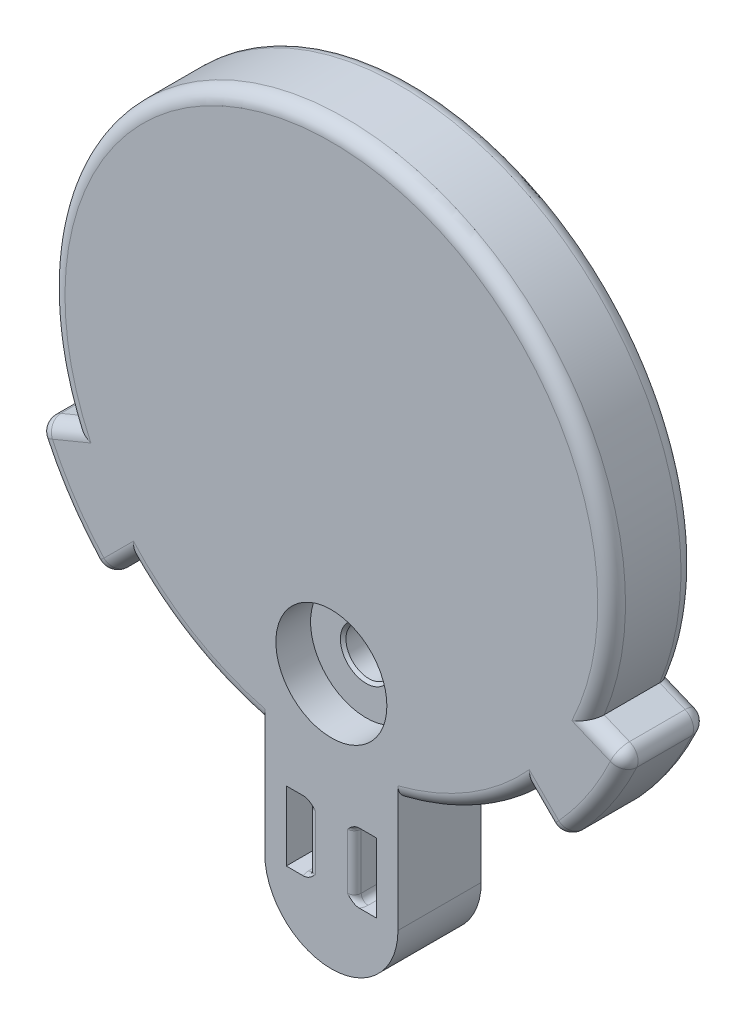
ISO-10303-21;
HEADER;
FILE_DESCRIPTION(('STEP AP214'),'2;1');
FILE_NAME('part.step','',(''),(''),'','','');
FILE_SCHEMA(('AUTOMOTIVE_DESIGN { 1 0 10303 214 1 1 1 1 }'));
ENDSEC;
DATA;
#1=APPLICATION_CONTEXT('core data for automotive mechanical design processes');
#2=APPLICATION_PROTOCOL_DEFINITION('international standard','automotive_design',2000,#1);
#3=PRODUCT_CONTEXT('',#1,'mechanical');
#4=PRODUCT('Part','Part','',(#3));
#5=PRODUCT_RELATED_PRODUCT_CATEGORY('part','',(#4));
#6=PRODUCT_DEFINITION_FORMATION('','',#4);
#7=PRODUCT_DEFINITION_CONTEXT('part definition',#1,'design');
#8=PRODUCT_DEFINITION('design','',#6,#7);
#9=PRODUCT_DEFINITION_SHAPE('','',#8);
#10=(LENGTH_UNIT() NAMED_UNIT(*) SI_UNIT(.MILLI.,.METRE.));
#11=(NAMED_UNIT(*) PLANE_ANGLE_UNIT() SI_UNIT($,.RADIAN.));
#12=(NAMED_UNIT(*) SI_UNIT($,.STERADIAN.) SOLID_ANGLE_UNIT());
#13=UNCERTAINTY_MEASURE_WITH_UNIT(LENGTH_MEASURE(1.E-05),#10,'distance_accuracy_value','');
#14=(GEOMETRIC_REPRESENTATION_CONTEXT(3) GLOBAL_UNCERTAINTY_ASSIGNED_CONTEXT((#13)) GLOBAL_UNIT_ASSIGNED_CONTEXT((#10,
#11,#12)) REPRESENTATION_CONTEXT('',''));
#15=CARTESIAN_POINT('',(0.,0.,0.));
#16=DIRECTION('',(0.,0.,1.));
#17=DIRECTION('',(1.,0.,0.));
#18=AXIS2_PLACEMENT_3D('',#15,#16,#17);
#19=CARTESIAN_POINT('',(1.65000000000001,-22.6214168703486,0.));
#20=DIRECTION('',(-1.,0.,0.));
#21=DIRECTION('',(0.,-1.,0.));
#22=AXIS2_PLACEMENT_3D('',#19,#20,#21);
#23=PLANE('',#22);
#24=DIRECTION('',(0.,-1.,0.));
#25=VECTOR('',#24,1.);
#26=CARTESIAN_POINT('',(1.65000000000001,-27.6214168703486,5.5));
#27=LINE('',#26,#25);
#28=CARTESIAN_POINT('',(1.65000000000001,-23.1214168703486,5.5));
#29=VERTEX_POINT('',#28);
#30=CARTESIAN_POINT('',(1.65000000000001,-27.1214168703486,5.5));
#31=VERTEX_POINT('',#30);
#32=EDGE_CURVE('E481',#29,#31,#27,.T.);
#33=ORIENTED_EDGE('',*,*,#32,.T.);
#34=DIRECTION('',(0.,0.,1.));
#35=VECTOR('',#34,1.);
#36=CARTESIAN_POINT('',(1.65000000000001,-27.1214168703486,1.));
#37=LINE('',#36,#35);
#38=CARTESIAN_POINT('',(1.65000000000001,-27.1214168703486,1.5));
#39=VERTEX_POINT('',#38);
#40=EDGE_CURVE('E584',#31,#39,#37,.F.);
#41=ORIENTED_EDGE('',*,*,#40,.T.);
#42=DIRECTION('',(0.,-1.,0.));
#43=VECTOR('',#42,1.);
#44=CARTESIAN_POINT('',(1.65000000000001,-22.6214168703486,1.5));
#45=LINE('',#44,#43);
#46=CARTESIAN_POINT('',(1.65000000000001,-23.1214168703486,1.5));
#47=VERTEX_POINT('',#46);
#48=EDGE_CURVE('E581',#39,#47,#45,.F.);
#49=ORIENTED_EDGE('',*,*,#48,.T.);
#50=DIRECTION('',(0.,0.,1.));
#51=VECTOR('',#50,1.);
#52=CARTESIAN_POINT('',(1.65000000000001,-23.1214168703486,5.5));
#53=LINE('',#52,#51);
#54=EDGE_CURVE('E578',#47,#29,#53,.T.);
#55=ORIENTED_EDGE('',*,*,#54,.T.);
#56=EDGE_LOOP('',(#33,#41,#49,#55));
#57=FACE_BOUND('',#56,.T.);
#58=ADVANCED_FACE('F59',(#57),#23,.F.);
#59=CARTESIAN_POINT('',(-1.65000000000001,-22.6214168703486,0.));
#60=DIRECTION('',(1.,0.,0.));
#61=DIRECTION('',(0.,1.,0.));
#62=AXIS2_PLACEMENT_3D('',#59,#60,#61);
#63=PLANE('',#62);
#64=DIRECTION('',(0.,1.,0.));
#65=VECTOR('',#64,1.);
#66=CARTESIAN_POINT('',(-1.65000000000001,-27.6214168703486,1.5));
#67=LINE('',#66,#65);
#68=CARTESIAN_POINT('',(-1.65000000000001,-23.1214168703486,1.5));
#69=VERTEX_POINT('',#68);
#70=CARTESIAN_POINT('',(-1.65000000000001,-27.1214168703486,1.5));
#71=VERTEX_POINT('',#70);
#72=EDGE_CURVE('E527',#69,#71,#67,.F.);
#73=ORIENTED_EDGE('',*,*,#72,.T.);
#74=DIRECTION('',(0.,0.,1.));
#75=VECTOR('',#74,1.);
#76=CARTESIAN_POINT('',(-1.65000000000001,-27.1214168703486,5.5));
#77=LINE('',#76,#75);
#78=CARTESIAN_POINT('',(-1.65000000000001,-27.1214168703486,5.5));
#79=VERTEX_POINT('',#78);
#80=EDGE_CURVE('E533',#71,#79,#77,.T.);
#81=ORIENTED_EDGE('',*,*,#80,.T.);
#82=DIRECTION('',(0.,1.,0.));
#83=VECTOR('',#82,1.);
#84=CARTESIAN_POINT('',(-1.65000000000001,-22.6214168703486,5.5));
#85=LINE('',#84,#83);
#86=CARTESIAN_POINT('',(-1.65000000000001,-23.1214168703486,5.5));
#87=VERTEX_POINT('',#86);
#88=EDGE_CURVE('E493',#79,#87,#85,.T.);
#89=ORIENTED_EDGE('',*,*,#88,.T.);
#90=DIRECTION('',(0.,0.,1.));
#91=VECTOR('',#90,1.);
#92=CARTESIAN_POINT('',(-1.65000000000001,-23.1214168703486,1.));
#93=LINE('',#92,#91);
#94=EDGE_CURVE('E530',#87,#69,#93,.F.);
#95=ORIENTED_EDGE('',*,*,#94,.T.);
#96=EDGE_LOOP('',(#73,#81,#89,#95));
#97=FACE_BOUND('',#96,.T.);
#98=ADVANCED_FACE('F960',(#97),#63,.F.);
#99=CARTESIAN_POINT('',(0.,-14.,6.));
#100=DIRECTION('',(0.,0.,-1.));
#101=DIRECTION('',(-1.,0.,0.));
#102=AXIS2_PLACEMENT_3D('',#99,#100,#101);
#103=CYLINDRICAL_SURFACE('',#102,1.65);
#104=CARTESIAN_POINT('',(0.,-14.,3.3));
#105=DIRECTION('',(0.,0.,1.));
#106=DIRECTION('',(1.,0.,0.));
#107=AXIS2_PLACEMENT_3D('',#104,#105,#106);
#108=CIRCLE('',#107,1.65);
#109=CARTESIAN_POINT('',(1.64999999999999,-14.,3.3));
#110=VERTEX_POINT('',#109);
#111=EDGE_CURVE('E473',#110,#110,#108,.T.);
#112=ORIENTED_EDGE('',*,*,#111,.T.);
#113=EDGE_LOOP('',(#112));
#114=FACE_BOUND('',#113,.T.);
#115=CARTESIAN_POINT('',(0.,-14.,0.));
#116=DIRECTION('',(0.,0.,-1.));
#117=DIRECTION('',(-1.,0.,0.));
#118=AXIS2_PLACEMENT_3D('',#115,#116,#117);
#119=CIRCLE('',#118,1.65);
#120=CARTESIAN_POINT('',(-1.65000000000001,-14.,0.));
#121=VERTEX_POINT('',#120);
#122=EDGE_CURVE('E395',#121,#121,#119,.T.);
#123=ORIENTED_EDGE('',*,*,#122,.T.);
#124=EDGE_LOOP('',(#123));
#125=FACE_BOUND('',#124,.T.);
#126=ADVANCED_FACE('F941',(#114,#125),#103,.F.);
#127=CARTESIAN_POINT('',(0.,0.,6.));
#128=DIRECTION('',(0.707106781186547,0.707106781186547,0.));
#129=DIRECTION('',(-0.707106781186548,0.707106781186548,0.));
#130=AXIS2_PLACEMENT_3D('',#127,#128,#129);
#131=PLANE('',#130);
#132=DIRECTION('',(0.,0.,-1.));
#133=VECTOR('',#132,1.);
#134=CARTESIAN_POINT('',(14.2835569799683,-14.2835569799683,6.));
#135=LINE('',#134,#133);
#136=CARTESIAN_POINT('',(14.2835569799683,-14.2835569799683,5.));
#137=VERTEX_POINT('',#136);
#138=CARTESIAN_POINT('',(14.2835569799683,-14.2835569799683,1.));
#139=VERTEX_POINT('',#138);
#140=EDGE_CURVE('E435',#137,#139,#135,.T.);
#141=ORIENTED_EDGE('',*,*,#140,.T.);
#142=DIRECTION('',(0.707106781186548,-0.707106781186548,0.));
#143=VECTOR('',#142,1.);
#144=CARTESIAN_POINT('',(0.,0.,1.));
#145=LINE('',#144,#143);
#146=CARTESIAN_POINT('',(15.6818366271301,-15.6818366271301,1.));
#147=VERTEX_POINT('',#146);
#148=EDGE_CURVE('E1093',#139,#147,#145,.T.);
#149=ORIENTED_EDGE('',*,*,#148,.T.);
#150=DIRECTION('',(0.,0.,-1.));
#151=VECTOR('',#150,1.);
#152=CARTESIAN_POINT('',(15.6818366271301,-15.6818366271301,6.));
#153=LINE('',#152,#151);
#154=CARTESIAN_POINT('',(15.6818366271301,-15.6818366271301,5.));
#155=VERTEX_POINT('',#154);
#156=EDGE_CURVE('E1089',#147,#155,#153,.F.);
#157=ORIENTED_EDGE('',*,*,#156,.T.);
#158=DIRECTION('',(0.707106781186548,-0.707106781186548,0.));
#159=VECTOR('',#158,1.);
#160=CARTESIAN_POINT('',(14.2835569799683,-14.2835569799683,5.));
#161=LINE('',#160,#159);
#162=EDGE_CURVE('E1086',#155,#137,#161,.F.);
#163=ORIENTED_EDGE('',*,*,#162,.T.);
#164=EDGE_LOOP('',(#141,#149,#157,#163));
#165=FACE_BOUND('',#164,.T.);
#166=ADVANCED_FACE('F937',(#165),#131,.F.);
#167=CARTESIAN_POINT('',(0.,0.,6.));
#168=DIRECTION('',(0.,0.,-1.));
#169=DIRECTION('',(-1.,0.,0.));
#170=AXIS2_PLACEMENT_3D('',#167,#168,#169);
#171=CYLINDRICAL_SURFACE('',#170,23.2);
#172=DIRECTION('',(0.,0.,-1.));
#173=VECTOR('',#172,1.);
#174=CARTESIAN_POINT('',(17.127184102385,-15.6492672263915,6.));
#175=LINE('',#174,#173);
#176=CARTESIAN_POINT('',(17.127184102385,-15.6492672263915,5.));
#177=VERTEX_POINT('',#176);
#178=CARTESIAN_POINT('',(17.127184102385,-15.6492672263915,1.));
#179=VERTEX_POINT('',#178);
#180=EDGE_CURVE('E1076',#177,#179,#175,.T.);
#181=ORIENTED_EDGE('',*,*,#180,.T.);
#182=CARTESIAN_POINT('',(0.,0.,1.));
#183=DIRECTION('',(0.,0.,1.));
#184=DIRECTION('',(1.,0.,0.));
#185=AXIS2_PLACEMENT_3D('',#182,#183,#184);
#186=CIRCLE('',#185,23.2);
#187=CARTESIAN_POINT('',(21.0123272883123,-9.83473954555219,1.));
#188=VERTEX_POINT('',#187);
#189=EDGE_CURVE('E1083',#179,#188,#186,.T.);
#190=ORIENTED_EDGE('',*,*,#189,.T.);
#191=DIRECTION('',(0.,0.,-1.));
#192=VECTOR('',#191,1.);
#193=CARTESIAN_POINT('',(21.0123272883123,-9.83473954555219,6.));
#194=LINE('',#193,#192);
#195=CARTESIAN_POINT('',(21.0123272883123,-9.83473954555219,5.));
#196=VERTEX_POINT('',#195);
#197=EDGE_CURVE('E1079',#188,#196,#194,.F.);
#198=ORIENTED_EDGE('',*,*,#197,.T.);
#199=CARTESIAN_POINT('',(0.,0.,5.));
#200=DIRECTION('',(0.,0.,1.));
#201=DIRECTION('',(1.,0.,0.));
#202=AXIS2_PLACEMENT_3D('',#199,#200,#201);
#203=CIRCLE('',#202,23.2);
#204=EDGE_CURVE('E1073',#196,#177,#203,.F.);
#205=ORIENTED_EDGE('',*,*,#204,.T.);
#206=EDGE_LOOP('',(#181,#190,#198,#205));
#207=FACE_BOUND('',#206,.T.);
#208=ADVANCED_FACE('F933',(#207),#171,.T.);
#209=CARTESIAN_POINT('',(0.,0.,6.));
#210=DIRECTION('',(0.382683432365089,0.923879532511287,0.));
#211=DIRECTION('',(-0.923879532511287,0.382683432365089,0.));
#212=AXIS2_PLACEMENT_3D('',#209,#210,#211);
#213=PLANE('',#212);
#214=DIRECTION('',(0.,0.,1.));
#215=VECTOR('',#214,1.);
#216=CARTESIAN_POINT('',(20.4893069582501,-8.48694882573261,0.));
#217=LINE('',#216,#215);
#218=CARTESIAN_POINT('',(20.4893069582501,-8.48694882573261,5.));
#219=VERTEX_POINT('',#218);
#220=CARTESIAN_POINT('',(20.4893069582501,-8.48694882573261,1.));
#221=VERTEX_POINT('',#220);
#222=EDGE_CURVE('E1066',#219,#221,#217,.F.);
#223=ORIENTED_EDGE('',*,*,#222,.T.);
#224=DIRECTION('',(0.923879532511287,-0.382683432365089,0.));
#225=VECTOR('',#224,1.);
#226=CARTESIAN_POINT('',(18.662366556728,-7.73020533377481,1.));
#227=LINE('',#226,#225);
#228=CARTESIAN_POINT('',(18.662366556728,-7.73020533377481,1.));
#229=VERTEX_POINT('',#228);
#230=EDGE_CURVE('E1070',#221,#229,#227,.F.);
#231=ORIENTED_EDGE('',*,*,#230,.T.);
#232=DIRECTION('',(0.,0.,-1.));
#233=VECTOR('',#232,1.);
#234=CARTESIAN_POINT('',(18.662366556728,-7.73020533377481,6.));
#235=LINE('',#234,#233);
#236=CARTESIAN_POINT('',(18.662366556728,-7.73020533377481,5.));
#237=VERTEX_POINT('',#236);
#238=EDGE_CURVE('E469',#237,#229,#235,.T.);
#239=ORIENTED_EDGE('',*,*,#238,.F.);
#240=DIRECTION('',(0.923879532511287,-0.382683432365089,0.));
#241=VECTOR('',#240,1.);
#242=CARTESIAN_POINT('',(0.,0.,5.));
#243=LINE('',#242,#241);
#244=EDGE_CURVE('E685',#237,#219,#243,.T.);
#245=ORIENTED_EDGE('',*,*,#244,.T.);
#246=EDGE_LOOP('',(#223,#231,#239,#245));
#247=FACE_BOUND('',#246,.T.);
#248=ADVANCED_FACE('F930',(#247),#213,.T.);
#249=CARTESIAN_POINT('',(0.,0.,6.));
#250=DIRECTION('',(0.,0.,-1.));
#251=DIRECTION('',(-1.,0.,0.));
#252=AXIS2_PLACEMENT_3D('',#249,#250,#251);
#253=CYLINDRICAL_SURFACE('',#252,20.2);
#254=ORIENTED_EDGE('',*,*,#238,.T.);
#255=CARTESIAN_POINT('',(0.,0.,1.));
#256=DIRECTION('',(0.,0.,1.));
#257=DIRECTION('',(1.,0.,0.));
#258=AXIS2_PLACEMENT_3D('',#255,#256,#257);
#259=CIRCLE('',#258,20.2);
#260=CARTESIAN_POINT('',(-18.662366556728,-7.73020533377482,1.));
#261=VERTEX_POINT('',#260);
#262=EDGE_CURVE('E1164',#229,#261,#259,.T.);
#263=ORIENTED_EDGE('',*,*,#262,.T.);
#264=DIRECTION('',(0.,0.,-1.));
#265=VECTOR('',#264,1.);
#266=CARTESIAN_POINT('',(-18.662366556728,-7.73020533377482,6.));
#267=LINE('',#266,#265);
#268=CARTESIAN_POINT('',(-18.662366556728,-7.73020533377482,5.));
#269=VERTEX_POINT('',#268);
#270=EDGE_CURVE('E465',#269,#261,#267,.T.);
#271=ORIENTED_EDGE('',*,*,#270,.F.);
#272=CARTESIAN_POINT('',(0.,0.,5.));
#273=DIRECTION('',(0.,0.,1.));
#274=DIRECTION('',(1.,0.,0.));
#275=AXIS2_PLACEMENT_3D('',#272,#273,#274);
#276=CIRCLE('',#275,20.2);
#277=EDGE_CURVE('E1161',#269,#237,#276,.F.);
#278=ORIENTED_EDGE('',*,*,#277,.T.);
#279=EDGE_LOOP('',(#254,#263,#271,#278));
#280=FACE_BOUND('',#279,.T.);
#281=ADVANCED_FACE('F928',(#280),#253,.T.);
#282=CARTESIAN_POINT('',(0.,0.,6.));
#283=DIRECTION('',(0.382683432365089,-0.923879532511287,0.));
#284=DIRECTION('',(0.923879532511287,0.382683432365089,0.));
#285=AXIS2_PLACEMENT_3D('',#282,#283,#284);
#286=PLANE('',#285);
#287=ORIENTED_EDGE('',*,*,#270,.T.);
#288=DIRECTION('',(-0.923879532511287,-0.382683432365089,0.));
#289=VECTOR('',#288,1.);
#290=CARTESIAN_POINT('',(0.,0.,1.));
#291=LINE('',#290,#289);
#292=CARTESIAN_POINT('',(-20.4893069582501,-8.48694882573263,1.));
#293=VERTEX_POINT('',#292);
#294=EDGE_CURVE('E1124',#261,#293,#291,.T.);
#295=ORIENTED_EDGE('',*,*,#294,.T.);
#296=DIRECTION('',(0.,0.,-1.));
#297=VECTOR('',#296,1.);
#298=CARTESIAN_POINT('',(-20.4893069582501,-8.48694882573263,6.));
#299=LINE('',#298,#297);
#300=CARTESIAN_POINT('',(-20.4893069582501,-8.48694882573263,5.));
#301=VERTEX_POINT('',#300);
#302=EDGE_CURVE('E1121',#293,#301,#299,.F.);
#303=ORIENTED_EDGE('',*,*,#302,.T.);
#304=DIRECTION('',(-0.923879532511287,-0.382683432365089,0.));
#305=VECTOR('',#304,1.);
#306=CARTESIAN_POINT('',(-18.662366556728,-7.73020533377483,5.));
#307=LINE('',#306,#305);
#308=EDGE_CURVE('E1118',#301,#269,#307,.F.);
#309=ORIENTED_EDGE('',*,*,#308,.T.);
#310=EDGE_LOOP('',(#287,#295,#303,#309));
#311=FACE_BOUND('',#310,.T.);
#312=ADVANCED_FACE('F924',(#311),#286,.F.);
#313=CARTESIAN_POINT('',(0.,0.,6.));
#314=DIRECTION('',(0.,0.,-1.));
#315=DIRECTION('',(-1.,0.,0.));
#316=AXIS2_PLACEMENT_3D('',#313,#314,#315);
#317=CYLINDRICAL_SURFACE('',#316,23.2);
#318=DIRECTION('',(0.,0.,-1.));
#319=VECTOR('',#318,1.);
#320=CARTESIAN_POINT('',(-21.0123272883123,-9.8347395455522,6.));
#321=LINE('',#320,#319);
#322=CARTESIAN_POINT('',(-21.0123272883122,-9.8347395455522,5.));
#323=VERTEX_POINT('',#322);
#324=CARTESIAN_POINT('',(-21.0123272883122,-9.8347395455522,1.));
#325=VERTEX_POINT('',#324);
#326=EDGE_CURVE('E1108',#323,#325,#321,.T.);
#327=ORIENTED_EDGE('',*,*,#326,.T.);
#328=CARTESIAN_POINT('',(0.,0.,1.));
#329=DIRECTION('',(0.,0.,1.));
#330=DIRECTION('',(1.,0.,0.));
#331=AXIS2_PLACEMENT_3D('',#328,#329,#330);
#332=CIRCLE('',#331,23.2);
#333=CARTESIAN_POINT('',(-17.127184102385,-15.6492672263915,1.));
#334=VERTEX_POINT('',#333);
#335=EDGE_CURVE('E1115',#325,#334,#332,.T.);
#336=ORIENTED_EDGE('',*,*,#335,.T.);
#337=DIRECTION('',(0.,0.,-1.));
#338=VECTOR('',#337,1.);
#339=CARTESIAN_POINT('',(-17.127184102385,-15.6492672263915,6.));
#340=LINE('',#339,#338);
#341=CARTESIAN_POINT('',(-17.127184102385,-15.6492672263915,5.));
#342=VERTEX_POINT('',#341);
#343=EDGE_CURVE('E1111',#334,#342,#340,.F.);
#344=ORIENTED_EDGE('',*,*,#343,.T.);
#345=CARTESIAN_POINT('',(0.,0.,5.));
#346=DIRECTION('',(0.,0.,1.));
#347=DIRECTION('',(1.,0.,0.));
#348=AXIS2_PLACEMENT_3D('',#345,#346,#347);
#349=CIRCLE('',#348,23.2);
#350=EDGE_CURVE('E1105',#342,#323,#349,.F.);
#351=ORIENTED_EDGE('',*,*,#350,.T.);
#352=EDGE_LOOP('',(#327,#336,#344,#351));
#353=FACE_BOUND('',#352,.T.);
#354=ADVANCED_FACE('F920',(#353),#317,.T.);
#355=CARTESIAN_POINT('',(0.,0.,6.));
#356=DIRECTION('',(0.707106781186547,-0.707106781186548,0.));
#357=DIRECTION('',(0.707106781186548,0.707106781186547,0.));
#358=AXIS2_PLACEMENT_3D('',#355,#356,#357);
#359=PLANE('',#358);
#360=DIRECTION('',(0.,0.,1.));
#361=VECTOR('',#360,1.);
#362=CARTESIAN_POINT('',(-15.6818366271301,-15.6818366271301,0.));
#363=LINE('',#362,#361);
#364=CARTESIAN_POINT('',(-15.6818366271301,-15.6818366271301,5.));
#365=VERTEX_POINT('',#364);
#366=CARTESIAN_POINT('',(-15.6818366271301,-15.6818366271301,1.));
#367=VERTEX_POINT('',#366);
#368=EDGE_CURVE('E1099',#365,#367,#363,.F.);
#369=ORIENTED_EDGE('',*,*,#368,.T.);
#370=DIRECTION('',(-0.707106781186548,-0.707106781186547,0.));
#371=VECTOR('',#370,1.);
#372=CARTESIAN_POINT('',(-14.2835569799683,-14.2835569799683,1.));
#373=LINE('',#372,#371);
#374=CARTESIAN_POINT('',(-14.2835569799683,-14.2835569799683,1.));
#375=VERTEX_POINT('',#374);
#376=EDGE_CURVE('E1102',#367,#375,#373,.F.);
#377=ORIENTED_EDGE('',*,*,#376,.T.);
#378=DIRECTION('',(0.,0.,-1.));
#379=VECTOR('',#378,1.);
#380=CARTESIAN_POINT('',(-14.2835569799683,-14.2835569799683,6.));
#381=LINE('',#380,#379);
#382=CARTESIAN_POINT('',(-14.2835569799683,-14.2835569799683,5.));
#383=VERTEX_POINT('',#382);
#384=EDGE_CURVE('E461',#383,#375,#381,.T.);
#385=ORIENTED_EDGE('',*,*,#384,.F.);
#386=DIRECTION('',(-0.707106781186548,-0.707106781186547,0.));
#387=VECTOR('',#386,1.);
#388=CARTESIAN_POINT('',(0.,0.,5.));
#389=LINE('',#388,#387);
#390=EDGE_CURVE('E1096',#383,#365,#389,.T.);
#391=ORIENTED_EDGE('',*,*,#390,.T.);
#392=EDGE_LOOP('',(#369,#377,#385,#391));
#393=FACE_BOUND('',#392,.T.);
#394=ADVANCED_FACE('F916',(#393),#359,.T.);
#395=ORIENTED_EDGE('',*,*,#384,.T.);
#396=CARTESIAN_POINT('',(0.,0.,1.));
#397=DIRECTION('',(0.,0.,1.));
#398=DIRECTION('',(1.,0.,0.));
#399=AXIS2_PLACEMENT_3D('',#396,#397,#398);
#400=CIRCLE('',#399,20.2);
#401=CARTESIAN_POINT('',(-4.8,-19.6214168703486,1.));
#402=VERTEX_POINT('',#401);
#403=EDGE_CURVE('E1170',#375,#402,#400,.T.);
#404=ORIENTED_EDGE('',*,*,#403,.T.);
#405=DIRECTION('',(0.,0.,-1.));
#406=VECTOR('',#405,1.);
#407=CARTESIAN_POINT('',(-4.8,-19.6214168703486,6.));
#408=LINE('',#407,#406);
#409=CARTESIAN_POINT('',(-4.8,-19.6214168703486,5.));
#410=VERTEX_POINT('',#409);
#411=EDGE_CURVE('E457',#410,#402,#408,.T.);
#412=ORIENTED_EDGE('',*,*,#411,.F.);
#413=CARTESIAN_POINT('',(0.,0.,5.));
#414=DIRECTION('',(0.,0.,1.));
#415=DIRECTION('',(1.,0.,0.));
#416=AXIS2_PLACEMENT_3D('',#413,#414,#415);
#417=CIRCLE('',#416,20.2);
#418=EDGE_CURVE('E1167',#410,#383,#417,.F.);
#419=ORIENTED_EDGE('',*,*,#418,.T.);
#420=EDGE_LOOP('',(#395,#404,#412,#419));
#421=FACE_BOUND('',#420,.T.);
#422=ADVANCED_FACE('F915',(#421),#253,.T.);
#423=CARTESIAN_POINT('',(-4.8,0.,6.));
#424=DIRECTION('',(-1.,0.,0.));
#425=DIRECTION('',(0.,0.,1.));
#426=AXIS2_PLACEMENT_3D('',#423,#424,#425);
#427=PLANE('',#426);
#428=DIRECTION('',(0.,1.,0.));
#429=VECTOR('',#428,1.);
#430=CARTESIAN_POINT('',(-4.8,0.,0.));
#431=LINE('',#430,#429);
#432=CARTESIAN_POINT('',(-4.8,-27.6214168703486,0.));
#433=VERTEX_POINT('',#432);
#434=CARTESIAN_POINT('',(-4.8,-18.5903200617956,0.));
#435=VERTEX_POINT('',#434);
#436=EDGE_CURVE('E406',#433,#435,#431,.T.);
#437=ORIENTED_EDGE('',*,*,#436,.F.);
#438=DIRECTION('',(0.,0.,-1.));
#439=VECTOR('',#438,1.);
#440=CARTESIAN_POINT('',(-4.8,-27.6214168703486,6.));
#441=LINE('',#440,#439);
#442=CARTESIAN_POINT('',(-4.8,-27.6214168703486,6.));
#443=VERTEX_POINT('',#442);
#444=EDGE_CURVE('E454',#443,#433,#441,.T.);
#445=ORIENTED_EDGE('',*,*,#444,.F.);
#446=DIRECTION('',(0.,1.,0.));
#447=VECTOR('',#446,1.);
#448=CARTESIAN_POINT('',(-4.8,0.,6.));
#449=LINE('',#448,#447);
#450=CARTESIAN_POINT('',(-4.8,-18.5903200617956,6.));
#451=VERTEX_POINT('',#450);
#452=EDGE_CURVE('E82',#443,#451,#449,.T.);
#453=ORIENTED_EDGE('',*,*,#452,.T.);
#454=CARTESIAN_POINT('',(-4.8,-18.5903200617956,6.));
#455=CARTESIAN_POINT('',(-4.8,-18.6497104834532,6.00004208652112));
#456=CARTESIAN_POINT('',(-4.8,-18.7091003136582,5.99504195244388));
#457=CARTESIAN_POINT('',(-4.8,-18.8262353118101,5.97523326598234));
#458=CARTESIAN_POINT('',(-4.8,-18.8839800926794,5.96042242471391));
#459=CARTESIAN_POINT('',(-4.8,-18.9962010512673,5.92125155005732));
#460=CARTESIAN_POINT('',(-4.8,-19.0506743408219,5.89688321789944));
#461=CARTESIAN_POINT('',(-4.8,-19.1546394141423,5.83920801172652));
#462=CARTESIAN_POINT('',(-4.8,-19.204133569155,5.80590542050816));
#463=CARTESIAN_POINT('',(-4.8,-19.2958327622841,5.73184091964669));
#464=CARTESIAN_POINT('',(-4.8,-19.3381453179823,5.69121224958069));
#465=CARTESIAN_POINT('',(-4.8,-19.4151064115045,5.60322313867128));
#466=CARTESIAN_POINT('',(-4.8,-19.4497539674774,5.55586183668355));
#467=CARTESIAN_POINT('',(-4.8,-19.5093035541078,5.45726097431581));
#468=CARTESIAN_POINT('',(-4.8,-19.5344612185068,5.40617556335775));
#469=CARTESIAN_POINT('',(-4.8,-19.5755669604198,5.30044945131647));
#470=CARTESIAN_POINT('',(-4.8,-19.5915244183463,5.24581243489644));
#471=CARTESIAN_POINT('',(-4.8,-19.6088655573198,5.15892350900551));
#472=CARTESIAN_POINT('',(-4.8,-19.6135699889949,5.12729923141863));
#473=CARTESIAN_POINT('',(-4.8,-19.6198443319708,5.06378851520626));
#474=CARTESIAN_POINT('',(-4.8,-19.6214188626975,5.0319025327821));
#475=CARTESIAN_POINT('',(-4.8,-19.6214168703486,5.));
#476=B_SPLINE_CURVE_WITH_KNOTS('',3,(#454,#455,#456,#457,#458,#459,#460,#461,#462,#463,#464,
#465,#466,#467,#468,#469,#470,#471,#472,#473,#474,#475),.UNSPECIFIED.,.F.,.F.,(4,2,2,2,2,2,2,2,
2,2,4),(0.,0.177962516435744,0.355966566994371,0.534125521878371,0.712199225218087,
0.887311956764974,1.06244710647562,1.23245455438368,1.40228835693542,1.49806614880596,
1.59370247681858),.UNSPECIFIED.);
#477=EDGE_CURVE('E74',#451,#410,#476,.T.);
#478=ORIENTED_EDGE('',*,*,#477,.T.);
#479=ORIENTED_EDGE('',*,*,#411,.T.);
#480=CARTESIAN_POINT('',(-4.8,-19.6214168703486,1.));
#481=CARTESIAN_POINT('',(-4.8,-19.6214170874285,0.972457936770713));
#482=CARTESIAN_POINT('',(-4.8,-19.6202447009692,0.944929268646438));
#483=CARTESIAN_POINT('',(-4.8,-19.615570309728,0.890073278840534));
#484=CARTESIAN_POINT('',(-4.8,-19.6120685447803,0.862745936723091));
#485=CARTESIAN_POINT('',(-4.8,-19.5981146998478,0.781450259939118));
#486=CARTESIAN_POINT('',(-4.8,-19.5842138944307,0.728033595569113));
#487=CARTESIAN_POINT('',(-4.8,-19.547663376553,0.624305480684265));
#488=CARTESIAN_POINT('',(-4.8,-19.5250118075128,0.573994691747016));
#489=CARTESIAN_POINT('',(-4.8,-19.471680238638,0.477822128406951));
#490=CARTESIAN_POINT('',(-4.8,-19.4409999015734,0.431960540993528));
#491=CARTESIAN_POINT('',(-4.8,-19.3721395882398,0.345369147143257));
#492=CARTESIAN_POINT('',(-4.8,-19.3338743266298,0.304707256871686));
#493=CARTESIAN_POINT('',(-4.8,-19.2512167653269,0.230171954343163));
#494=CARTESIAN_POINT('',(-4.8,-19.2068230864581,0.196300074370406));
#495=CARTESIAN_POINT('',(-4.8,-19.1118858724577,0.13531973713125));
#496=CARTESIAN_POINT('',(-4.8,-19.0612072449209,0.108421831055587));
#497=CARTESIAN_POINT('',(-4.8,-18.9561433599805,0.0632547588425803));
#498=CARTESIAN_POINT('',(-4.8,-18.9017586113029,0.0449844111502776));
#499=CARTESIAN_POINT('',(-4.8,-18.8044272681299,0.0208431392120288));
#500=CARTESIAN_POINT('',(-4.8,-18.7619505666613,0.0130292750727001));
#501=CARTESIAN_POINT('',(-4.8,-18.6764263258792,0.00260767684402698));
#502=CARTESIAN_POINT('',(-4.8,-18.6333797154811,-7.67843724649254E-06));
#503=CARTESIAN_POINT('',(-4.8,-18.5903200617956,0.));
#504=B_SPLINE_CURVE_WITH_KNOTS('',3,(#480,#481,#482,#483,#484,#485,#486,#487,#488,#489,#490,
#491,#492,#493,#494,#495,#496,#497,#498,#499,#500,#501,#502,#503),.UNSPECIFIED.,.F.,.F.,(4,2,2,
2,2,2,2,2,2,2,2,4),(0.,0.0825747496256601,0.165140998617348,0.329874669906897,0.494643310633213,
0.659418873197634,0.826164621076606,0.992947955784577,1.16429735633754,1.33562328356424,
1.46488670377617,1.59396047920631),.UNSPECIFIED.);
#505=EDGE_CURVE('E888',#402,#435,#504,.T.);
#506=ORIENTED_EDGE('',*,*,#505,.T.);
#507=EDGE_LOOP('',(#437,#445,#453,#478,#479,#506));
#508=FACE_BOUND('',#507,.T.);
#509=ADVANCED_FACE('F909',(#508),#427,.T.);
#510=CARTESIAN_POINT('',(0.,-27.6214168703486,6.));
#511=DIRECTION('',(0.,0.,-1.));
#512=DIRECTION('',(-1.,0.,0.));
#513=AXIS2_PLACEMENT_3D('',#510,#511,#512);
#514=CYLINDRICAL_SURFACE('',#513,4.8);
#515=CARTESIAN_POINT('',(0.,-27.6214168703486,0.));
#516=DIRECTION('',(0.,0.,1.));
#517=DIRECTION('',(1.,0.,0.));
#518=AXIS2_PLACEMENT_3D('',#515,#516,#517);
#519=CIRCLE('',#518,4.8);
#520=CARTESIAN_POINT('',(4.8,-27.6214168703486,0.));
#521=VERTEX_POINT('',#520);
#522=EDGE_CURVE('E438',#433,#521,#519,.T.);
#523=ORIENTED_EDGE('',*,*,#522,.T.);
#524=DIRECTION('',(0.,0.,-1.));
#525=VECTOR('',#524,1.);
#526=CARTESIAN_POINT('',(4.8,-27.6214168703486,6.));
#527=LINE('',#526,#525);
#528=CARTESIAN_POINT('',(4.8,-27.6214168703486,6.));
#529=VERTEX_POINT('',#528);
#530=EDGE_CURVE('E450',#529,#521,#527,.T.);
#531=ORIENTED_EDGE('',*,*,#530,.F.);
#532=CARTESIAN_POINT('',(0.,-27.6214168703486,6.));
#533=DIRECTION('',(0.,0.,1.));
#534=DIRECTION('',(1.,0.,0.));
#535=AXIS2_PLACEMENT_3D('',#532,#533,#534);
#536=CIRCLE('',#535,4.8);
#537=EDGE_CURVE('E428',#443,#529,#536,.T.);
#538=ORIENTED_EDGE('',*,*,#537,.F.);
#539=ORIENTED_EDGE('',*,*,#444,.T.);
#540=EDGE_LOOP('',(#523,#531,#538,#539));
#541=FACE_BOUND('',#540,.T.);
#542=ADVANCED_FACE('F914',(#541),#514,.T.);
#543=CARTESIAN_POINT('',(4.8,0.,6.));
#544=DIRECTION('',(-1.,0.,0.));
#545=DIRECTION('',(0.,0.,1.));
#546=AXIS2_PLACEMENT_3D('',#543,#544,#545);
#547=PLANE('',#546);
#548=DIRECTION('',(0.,1.,0.));
#549=VECTOR('',#548,1.);
#550=CARTESIAN_POINT('',(4.8,0.,0.));
#551=LINE('',#550,#549);
#552=CARTESIAN_POINT('',(4.8,-18.5903200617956,0.));
#553=VERTEX_POINT('',#552);
#554=EDGE_CURVE('E429',#521,#553,#551,.T.);
#555=ORIENTED_EDGE('',*,*,#554,.T.);
#556=CARTESIAN_POINT('',(4.8,-18.5903200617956,0.));
#557=CARTESIAN_POINT('',(4.8,-18.6497104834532,-4.20865211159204E-05));
#558=CARTESIAN_POINT('',(4.8,-18.7091003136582,0.0049580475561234));
#559=CARTESIAN_POINT('',(4.8,-18.8262353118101,0.0247667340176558));
#560=CARTESIAN_POINT('',(4.8,-18.8839800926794,0.0395775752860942));
#561=CARTESIAN_POINT('',(4.8,-18.9962010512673,0.0787484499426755));
#562=CARTESIAN_POINT('',(4.8,-19.0506743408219,0.103116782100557));
#563=CARTESIAN_POINT('',(4.8,-19.1546394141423,0.160791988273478));
#564=CARTESIAN_POINT('',(4.8,-19.204133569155,0.194094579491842));
#565=CARTESIAN_POINT('',(4.8,-19.2958327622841,0.268159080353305));
#566=CARTESIAN_POINT('',(4.8,-19.3381453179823,0.308787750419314));
#567=CARTESIAN_POINT('',(4.8,-19.4151064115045,0.396776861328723));
#568=CARTESIAN_POINT('',(4.8,-19.4497539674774,0.44413816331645));
#569=CARTESIAN_POINT('',(4.8,-19.5093035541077,0.542739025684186));
#570=CARTESIAN_POINT('',(4.8,-19.5344612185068,0.593824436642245));
#571=CARTESIAN_POINT('',(4.8,-19.5755669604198,0.699550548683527));
#572=CARTESIAN_POINT('',(4.8,-19.5915244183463,0.754187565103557));
#573=CARTESIAN_POINT('',(4.8,-19.6088655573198,0.841076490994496));
#574=CARTESIAN_POINT('',(4.8,-19.6135699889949,0.872700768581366));
#575=CARTESIAN_POINT('',(4.8,-19.6198443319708,0.936211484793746));
#576=CARTESIAN_POINT('',(4.8,-19.6214188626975,0.968097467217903));
#577=CARTESIAN_POINT('',(4.8,-19.6214168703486,0.999999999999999));
#578=B_SPLINE_CURVE_WITH_KNOTS('',3,(#556,#557,#558,#559,#560,#561,#562,#563,#564,#565,#566,
#567,#568,#569,#570,#571,#572,#573,#574,#575,#576,#577),.UNSPECIFIED.,.F.,.F.,(4,2,2,2,2,2,2,2,
2,2,4),(0.,0.177962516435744,0.355966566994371,0.534125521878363,0.712199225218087,
0.887311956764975,1.06244710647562,1.23245455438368,1.40228835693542,1.49806614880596,
1.59370247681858),.UNSPECIFIED.);
#579=CARTESIAN_POINT('',(4.8,-19.6214168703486,1.));
#580=VERTEX_POINT('',#579);
#581=EDGE_CURVE('E898',#553,#580,#578,.T.);
#582=ORIENTED_EDGE('',*,*,#581,.T.);
#583=DIRECTION('',(0.,0.,-1.));
#584=VECTOR('',#583,1.);
#585=CARTESIAN_POINT('',(4.8,-19.6214168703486,6.));
#586=LINE('',#585,#584);
#587=CARTESIAN_POINT('',(4.8,-19.6214168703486,5.));
#588=VERTEX_POINT('',#587);
#589=EDGE_CURVE('E446',#588,#580,#586,.T.);
#590=ORIENTED_EDGE('',*,*,#589,.F.);
#591=CARTESIAN_POINT('',(4.8,-19.6214168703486,5.));
#592=CARTESIAN_POINT('',(4.8,-19.6214170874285,5.02754206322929));
#593=CARTESIAN_POINT('',(4.8,-19.6202447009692,5.05507073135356));
#594=CARTESIAN_POINT('',(4.8,-19.615570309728,5.10992672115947));
#595=CARTESIAN_POINT('',(4.8,-19.6120685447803,5.13725406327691));
#596=CARTESIAN_POINT('',(4.8,-19.5981146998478,5.21854974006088));
#597=CARTESIAN_POINT('',(4.8,-19.5842138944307,5.27196640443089));
#598=CARTESIAN_POINT('',(4.8,-19.547663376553,5.37569451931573));
#599=CARTESIAN_POINT('',(4.8,-19.5250118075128,5.42600530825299));
#600=CARTESIAN_POINT('',(4.8,-19.471680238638,5.52217787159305));
#601=CARTESIAN_POINT('',(4.8,-19.4409999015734,5.56803945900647));
#602=CARTESIAN_POINT('',(4.8,-19.3721395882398,5.65463085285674));
#603=CARTESIAN_POINT('',(4.8,-19.3338743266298,5.69529274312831));
#604=CARTESIAN_POINT('',(4.8,-19.2512167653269,5.76982804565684));
#605=CARTESIAN_POINT('',(4.8,-19.2068230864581,5.80369992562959));
#606=CARTESIAN_POINT('',(4.8,-19.1118858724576,5.86468026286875));
#607=CARTESIAN_POINT('',(4.8,-19.0612072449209,5.89157816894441));
#608=CARTESIAN_POINT('',(4.8,-18.9561433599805,5.93674524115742));
#609=CARTESIAN_POINT('',(4.8,-18.9017586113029,5.95501558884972));
#610=CARTESIAN_POINT('',(4.8,-18.8044272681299,5.97915686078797));
#611=CARTESIAN_POINT('',(4.8,-18.7619505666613,5.9869707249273));
#612=CARTESIAN_POINT('',(4.8,-18.6764263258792,5.99739232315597));
#613=CARTESIAN_POINT('',(4.8,-18.6333797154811,6.00000767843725));
#614=CARTESIAN_POINT('',(4.8,-18.5903200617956,6.));
#615=B_SPLINE_CURVE_WITH_KNOTS('',3,(#591,#592,#593,#594,#595,#596,#597,#598,#599,#600,#601,
#602,#603,#604,#605,#606,#607,#608,#609,#610,#611,#612,#613,#614),.UNSPECIFIED.,.F.,.F.,(4,2,2,
2,2,2,2,2,2,2,2,4),(0.,0.0825747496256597,0.165140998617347,0.329874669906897,0.494643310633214,
0.659418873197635,0.826164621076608,0.99294795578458,1.16429735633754,1.33562328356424,
1.46488670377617,1.59396047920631),.UNSPECIFIED.);
#616=CARTESIAN_POINT('',(4.8,-18.5903200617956,6.));
#617=VERTEX_POINT('',#616);
#618=EDGE_CURVE('E12',#588,#617,#615,.T.);
#619=ORIENTED_EDGE('',*,*,#618,.T.);
#620=DIRECTION('',(0.,1.,0.));
#621=VECTOR('',#620,1.);
#622=CARTESIAN_POINT('',(4.8,0.,6.));
#623=LINE('',#622,#621);
#624=EDGE_CURVE('E432',#529,#617,#623,.T.);
#625=ORIENTED_EDGE('',*,*,#624,.F.);
#626=ORIENTED_EDGE('',*,*,#530,.T.);
#627=EDGE_LOOP('',(#555,#582,#590,#619,#625,#626));
#628=FACE_BOUND('',#627,.T.);
#629=ADVANCED_FACE('F1202',(#628),#547,.F.);
#630=ORIENTED_EDGE('',*,*,#589,.T.);
#631=CARTESIAN_POINT('',(0.,0.,1.));
#632=DIRECTION('',(0.,0.,1.));
#633=DIRECTION('',(1.,0.,0.));
#634=AXIS2_PLACEMENT_3D('',#631,#632,#633);
#635=CIRCLE('',#634,20.2);
#636=EDGE_CURVE('E1130',#580,#139,#635,.T.);
#637=ORIENTED_EDGE('',*,*,#636,.T.);
#638=ORIENTED_EDGE('',*,*,#140,.F.);
#639=CARTESIAN_POINT('',(0.,0.,5.));
#640=DIRECTION('',(0.,0.,1.));
#641=DIRECTION('',(1.,0.,0.));
#642=AXIS2_PLACEMENT_3D('',#639,#640,#641);
#643=CIRCLE('',#642,20.2);
#644=EDGE_CURVE('E1127',#137,#588,#643,.F.);
#645=ORIENTED_EDGE('',*,*,#644,.T.);
#646=EDGE_LOOP('',(#630,#637,#638,#645));
#647=FACE_BOUND('',#646,.T.);
#648=ADVANCED_FACE('F1209',(#647),#253,.T.);
#649=CARTESIAN_POINT('',(0.,0.,6.));
#650=DIRECTION('',(0.,0.,1.));
#651=DIRECTION('',(1.,0.,0.));
#652=AXIS2_PLACEMENT_3D('',#649,#650,#651);
#653=PLANE('',#652);
#654=CARTESIAN_POINT('',(0.,-14.,6.));
#655=DIRECTION('',(0.,0.,1.));
#656=DIRECTION('',(1.,0.,0.));
#657=AXIS2_PLACEMENT_3D('',#654,#655,#656);
#658=CIRCLE('',#657,4.);
#659=CARTESIAN_POINT('',(3.99999999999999,-14.,6.));
#660=VERTEX_POINT('',#659);
#661=EDGE_CURVE('E1063',#660,#660,#658,.T.);
#662=ORIENTED_EDGE('',*,*,#661,.F.);
#663=EDGE_LOOP('',(#662));
#664=FACE_BOUND('',#663,.T.);
#665=DIRECTION('',(-1.,0.,0.));
#666=VECTOR('',#665,1.);
#667=CARTESIAN_POINT('',(-3.25000000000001,-22.6214168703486,6.));
#668=LINE('',#667,#666);
#669=CARTESIAN_POINT('',(-2.01602540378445,-22.6214168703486,6.));
#670=VERTEX_POINT('',#669);
#671=CARTESIAN_POINT('',(-3.25000000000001,-22.6214168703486,6.));
#672=VERTEX_POINT('',#671);
#673=EDGE_CURVE('E389',#670,#672,#668,.T.);
#674=ORIENTED_EDGE('',*,*,#673,.F.);
#675=CARTESIAN_POINT('',(-2.01602540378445,-22.6214168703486,6.));
#676=CARTESIAN_POINT('',(-1.97311326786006,-22.6213919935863,6.));
#677=CARTESIAN_POINT('',(-1.93040948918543,-22.6255479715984,6.));
#678=CARTESIAN_POINT('',(-1.84680692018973,-22.640922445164,6.));
#679=CARTESIAN_POINT('',(-1.80589238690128,-22.6520534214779,6.));
#680=CARTESIAN_POINT('',(-1.71132069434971,-22.6853641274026,6.));
#681=CARTESIAN_POINT('',(-1.65858839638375,-22.7101141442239,6.));
#682=CARTESIAN_POINT('',(-1.55745469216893,-22.7675702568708,6.));
#683=CARTESIAN_POINT('',(-1.50907913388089,-22.8003200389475,6.));
#684=CARTESIAN_POINT('',(-1.40703294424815,-22.8779947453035,6.));
#685=CARTESIAN_POINT('',(-1.35424449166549,-22.9240442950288,6.));
#686=CARTESIAN_POINT('',(-1.25201459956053,-23.0194721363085,6.));
#687=CARTESIAN_POINT('',(-1.20257055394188,-23.0688477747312,6.));
#688=CARTESIAN_POINT('',(-1.15210818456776,-23.1193086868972,6.));
#689=CARTESIAN_POINT('',(-1.15105409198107,-23.1203627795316,6.));
#690=CARTESIAN_POINT('',(-1.15000000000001,-23.1214168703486,6.));
#691=B_SPLINE_CURVE_WITH_KNOTS('',3,(#675,#676,#677,#678,#679,#680,#681,#682,#683,#684,#685,
#686,#687,#688,#689,#690),.UNSPECIFIED.,.F.,.F.,(4,2,2,2,2,2,2,4),(0.,0.128226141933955,
0.254874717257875,0.428659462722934,0.603415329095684,0.813198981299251,1.02281723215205,
1.02728936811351),.UNSPECIFIED.);
#692=CARTESIAN_POINT('',(-1.15000000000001,-23.1214168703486,6.));
#693=VERTEX_POINT('',#692);
#694=EDGE_CURVE('E596',#670,#693,#691,.T.);
#695=ORIENTED_EDGE('',*,*,#694,.T.);
#696=DIRECTION('',(0.,1.,0.));
#697=VECTOR('',#696,1.);
#698=CARTESIAN_POINT('',(-1.15000000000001,-27.6214168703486,6.));
#699=LINE('',#698,#697);
#700=CARTESIAN_POINT('',(-1.15000000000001,-27.1214168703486,6.));
#701=VERTEX_POINT('',#700);
#702=EDGE_CURVE('E485',#693,#701,#699,.F.);
#703=ORIENTED_EDGE('',*,*,#702,.T.);
#704=CARTESIAN_POINT('',(-2.01602540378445,-27.6214168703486,6.));
#705=CARTESIAN_POINT('',(-1.97311326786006,-27.6214417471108,6.));
#706=CARTESIAN_POINT('',(-1.93040948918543,-27.6172857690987,6.));
#707=CARTESIAN_POINT('',(-1.84680692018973,-27.6019112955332,6.));
#708=CARTESIAN_POINT('',(-1.80589238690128,-27.5907803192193,6.));
#709=CARTESIAN_POINT('',(-1.71132069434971,-27.5574696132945,6.));
#710=CARTESIAN_POINT('',(-1.65858839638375,-27.5327195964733,6.));
#711=CARTESIAN_POINT('',(-1.55745469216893,-27.4752634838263,6.));
#712=CARTESIAN_POINT('',(-1.50907913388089,-27.4425137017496,6.));
#713=CARTESIAN_POINT('',(-1.40703294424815,-27.3648389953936,6.));
#714=CARTESIAN_POINT('',(-1.35424449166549,-27.3187894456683,6.));
#715=CARTESIAN_POINT('',(-1.25201459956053,-27.2233616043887,6.));
#716=CARTESIAN_POINT('',(-1.20257055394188,-27.1739859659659,6.));
#717=CARTESIAN_POINT('',(-1.15210818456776,-27.1235250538,6.));
#718=CARTESIAN_POINT('',(-1.15105409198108,-27.1224709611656,6.));
#719=CARTESIAN_POINT('',(-1.15000000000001,-27.1214168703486,6.));
#720=B_SPLINE_CURVE_WITH_KNOTS('',3,(#704,#705,#706,#707,#708,#709,#710,#711,#712,#713,#714,
#715,#716,#717,#718,#719),.UNSPECIFIED.,.F.,.F.,(4,2,2,2,2,2,2,4),(0.,0.128226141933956,
0.254874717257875,0.428659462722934,0.603415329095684,0.813198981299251,1.02281723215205,
1.02728936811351),.UNSPECIFIED.);
#721=CARTESIAN_POINT('',(-2.01602540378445,-27.6214168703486,6.));
#722=VERTEX_POINT('',#721);
#723=EDGE_CURVE('E587',#701,#722,#720,.F.);
#724=ORIENTED_EDGE('',*,*,#723,.T.);
#725=DIRECTION('',(1.,0.,0.));
#726=VECTOR('',#725,1.);
#727=CARTESIAN_POINT('',(-3.25000000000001,-27.6214168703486,6.));
#728=LINE('',#727,#726);
#729=CARTESIAN_POINT('',(-3.25000000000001,-27.6214168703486,6.));
#730=VERTEX_POINT('',#729);
#731=EDGE_CURVE('E392',#730,#722,#728,.T.);
#732=ORIENTED_EDGE('',*,*,#731,.F.);
#733=DIRECTION('',(0.,-1.,0.));
#734=VECTOR('',#733,1.);
#735=CARTESIAN_POINT('',(-3.25000000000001,-22.6214168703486,6.));
#736=LINE('',#735,#734);
#737=EDGE_CURVE('E368',#672,#730,#736,.T.);
#738=ORIENTED_EDGE('',*,*,#737,.F.);
#739=EDGE_LOOP('',(#674,#695,#703,#724,#732,#738));
#740=FACE_BOUND('',#739,.T.);
#741=DIRECTION('',(1.,0.,0.));
#742=VECTOR('',#741,1.);
#743=CARTESIAN_POINT('',(3.25000000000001,-27.6214168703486,6.));
#744=LINE('',#743,#742);
#745=CARTESIAN_POINT('',(2.01602540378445,-27.6214168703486,6.));
#746=VERTEX_POINT('',#745);
#747=CARTESIAN_POINT('',(3.25000000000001,-27.6214168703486,6.));
#748=VERTEX_POINT('',#747);
#749=EDGE_CURVE('E415',#746,#748,#744,.T.);
#750=ORIENTED_EDGE('',*,*,#749,.F.);
#751=CARTESIAN_POINT('',(2.01602540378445,-27.6214168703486,6.));
#752=CARTESIAN_POINT('',(1.97311326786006,-27.6214417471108,6.));
#753=CARTESIAN_POINT('',(1.93040948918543,-27.6172857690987,6.));
#754=CARTESIAN_POINT('',(1.84680692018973,-27.6019112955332,6.));
#755=CARTESIAN_POINT('',(1.80589238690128,-27.5907803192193,6.));
#756=CARTESIAN_POINT('',(1.71132069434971,-27.5574696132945,6.));
#757=CARTESIAN_POINT('',(1.65858839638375,-27.5327195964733,6.));
#758=CARTESIAN_POINT('',(1.55745469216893,-27.4752634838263,6.));
#759=CARTESIAN_POINT('',(1.50907913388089,-27.4425137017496,6.));
#760=CARTESIAN_POINT('',(1.40703294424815,-27.3648389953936,6.));
#761=CARTESIAN_POINT('',(1.35424449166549,-27.3187894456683,6.));
#762=CARTESIAN_POINT('',(1.25201459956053,-27.2233616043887,6.));
#763=CARTESIAN_POINT('',(1.20257055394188,-27.1739859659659,6.));
#764=CARTESIAN_POINT('',(1.15210818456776,-27.1235250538,6.));
#765=CARTESIAN_POINT('',(1.15105409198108,-27.1224709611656,6.));
#766=CARTESIAN_POINT('',(1.15000000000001,-27.1214168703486,6.));
#767=B_SPLINE_CURVE_WITH_KNOTS('',3,(#751,#752,#753,#754,#755,#756,#757,#758,#759,#760,#761,
#762,#763,#764,#765,#766),.UNSPECIFIED.,.F.,.F.,(4,2,2,2,2,2,2,4),(0.,0.128226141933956,
0.254874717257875,0.428659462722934,0.603415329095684,0.813198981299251,1.02281723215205,
1.02728936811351),.UNSPECIFIED.);
#768=CARTESIAN_POINT('',(1.15000000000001,-27.1214168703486,6.));
#769=VERTEX_POINT('',#768);
#770=EDGE_CURVE('E671',#746,#769,#767,.T.);
#771=ORIENTED_EDGE('',*,*,#770,.T.);
#772=DIRECTION('',(0.,-1.,0.));
#773=VECTOR('',#772,1.);
#774=CARTESIAN_POINT('',(1.15000000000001,-22.6214168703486,6.));
#775=LINE('',#774,#773);
#776=CARTESIAN_POINT('',(1.15000000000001,-23.1214168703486,6.));
#777=VERTEX_POINT('',#776);
#778=EDGE_CURVE('E489',#769,#777,#775,.F.);
#779=ORIENTED_EDGE('',*,*,#778,.T.);
#780=CARTESIAN_POINT('',(2.01602540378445,-22.6214168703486,6.));
#781=CARTESIAN_POINT('',(1.97311326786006,-22.6213919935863,6.));
#782=CARTESIAN_POINT('',(1.93040948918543,-22.6255479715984,6.));
#783=CARTESIAN_POINT('',(1.84680692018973,-22.640922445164,6.));
#784=CARTESIAN_POINT('',(1.80589238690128,-22.6520534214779,6.));
#785=CARTESIAN_POINT('',(1.71132069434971,-22.6853641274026,6.));
#786=CARTESIAN_POINT('',(1.65858839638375,-22.7101141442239,6.));
#787=CARTESIAN_POINT('',(1.55745469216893,-22.7675702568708,6.));
#788=CARTESIAN_POINT('',(1.50907913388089,-22.8003200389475,6.));
#789=CARTESIAN_POINT('',(1.40703294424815,-22.8779947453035,6.));
#790=CARTESIAN_POINT('',(1.35424449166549,-22.9240442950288,6.));
#791=CARTESIAN_POINT('',(1.25201459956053,-23.0194721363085,6.));
#792=CARTESIAN_POINT('',(1.20257055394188,-23.0688477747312,6.));
#793=CARTESIAN_POINT('',(1.15210818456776,-23.1193086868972,6.));
#794=CARTESIAN_POINT('',(1.15105409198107,-23.1203627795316,6.));
#795=CARTESIAN_POINT('',(1.15000000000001,-23.1214168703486,6.));
#796=B_SPLINE_CURVE_WITH_KNOTS('',3,(#780,#781,#782,#783,#784,#785,#786,#787,#788,#789,#790,
#791,#792,#793,#794,#795),.UNSPECIFIED.,.F.,.F.,(4,2,2,2,2,2,2,4),(0.,0.128226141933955,
0.254874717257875,0.428659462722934,0.603415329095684,0.813198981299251,1.02281723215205,
1.02728936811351),.UNSPECIFIED.);
#797=CARTESIAN_POINT('',(2.01602540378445,-22.6214168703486,6.));
#798=VERTEX_POINT('',#797);
#799=EDGE_CURVE('E678',#777,#798,#796,.F.);
#800=ORIENTED_EDGE('',*,*,#799,.T.);
#801=DIRECTION('',(-1.,0.,0.));
#802=VECTOR('',#801,1.);
#803=CARTESIAN_POINT('',(3.25000000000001,-22.6214168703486,6.));
#804=LINE('',#803,#802);
#805=CARTESIAN_POINT('',(3.25000000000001,-22.6214168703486,6.));
#806=VERTEX_POINT('',#805);
#807=EDGE_CURVE('E418',#806,#798,#804,.T.);
#808=ORIENTED_EDGE('',*,*,#807,.F.);
#809=DIRECTION('',(0.,1.,0.));
#810=VECTOR('',#809,1.);
#811=CARTESIAN_POINT('',(3.25000000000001,-22.6214168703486,6.));
#812=LINE('',#811,#810);
#813=EDGE_CURVE('E402',#748,#806,#812,.T.);
#814=ORIENTED_EDGE('',*,*,#813,.F.);
#815=EDGE_LOOP('',(#750,#771,#779,#800,#808,#814));
#816=FACE_BOUND('',#815,.T.);
#817=CARTESIAN_POINT('',(0.,0.,6.));
#818=DIRECTION('',(0.,0.,1.));
#819=DIRECTION('',(1.,0.,0.));
#820=AXIS2_PLACEMENT_3D('',#817,#818,#819);
#821=CIRCLE('',#820,19.2);
#822=CARTESIAN_POINT('',(-14.2651302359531,-12.85091667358,6.));
#823=VERTEX_POINT('',#822);
#824=EDGE_CURVE('E1195',#823,#451,#821,.T.);
#825=ORIENTED_EDGE('',*,*,#824,.T.);
#826=ORIENTED_EDGE('',*,*,#452,.F.);
#827=ORIENTED_EDGE('',*,*,#537,.T.);
#828=ORIENTED_EDGE('',*,*,#624,.T.);
#829=CARTESIAN_POINT('',(0.,0.,6.));
#830=DIRECTION('',(0.,0.,1.));
#831=DIRECTION('',(1.,0.,0.));
#832=AXIS2_PLACEMENT_3D('',#829,#830,#831);
#833=CIRCLE('',#832,19.2);
#834=CARTESIAN_POINT('',(14.2651302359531,-12.85091667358,6.));
#835=VERTEX_POINT('',#834);
#836=EDGE_CURVE('E1173',#617,#835,#833,.T.);
#837=ORIENTED_EDGE('',*,*,#836,.T.);
#838=DIRECTION('',(0.707106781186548,-0.707106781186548,0.));
#839=VECTOR('',#838,1.);
#840=CARTESIAN_POINT('',(17.1119841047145,-15.6977705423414,6.));
#841=LINE('',#840,#839);
#842=CARTESIAN_POINT('',(16.3889434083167,-14.9747298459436,6.));
#843=VERTEX_POINT('',#842);
#844=EDGE_CURVE('E1176',#835,#843,#841,.T.);
#845=ORIENTED_EDGE('',*,*,#844,.T.);
#846=CARTESIAN_POINT('',(0.,0.,6.));
#847=DIRECTION('',(0.,0.,1.));
#848=DIRECTION('',(1.,0.,0.));
#849=AXIS2_PLACEMENT_3D('',#846,#847,#848);
#850=CIRCLE('',#849,22.2);
#851=CARTESIAN_POINT('',(20.106623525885,-9.4108283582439,6.));
#852=VERTEX_POINT('',#851);
#853=EDGE_CURVE('E1179',#843,#852,#850,.T.);
#854=ORIENTED_EDGE('',*,*,#853,.T.);
#855=DIRECTION('',(0.923879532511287,-0.382683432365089,0.));
#856=VECTOR('',#855,1.);
#857=CARTESIAN_POINT('',(-0.382683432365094,-0.923879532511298,6.));
#858=LINE('',#857,#856);
#859=CARTESIAN_POINT('',(17.3317278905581,-8.26142895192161,6.));
#860=VERTEX_POINT('',#859);
#861=EDGE_CURVE('E1182',#852,#860,#858,.F.);
#862=ORIENTED_EDGE('',*,*,#861,.T.);
#863=CARTESIAN_POINT('',(0.,0.,6.));
#864=DIRECTION('',(0.,0.,1.));
#865=DIRECTION('',(1.,0.,0.));
#866=AXIS2_PLACEMENT_3D('',#863,#864,#865);
#867=CIRCLE('',#866,19.2);
#868=CARTESIAN_POINT('',(-17.3317278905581,-8.26142895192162,6.));
#869=VERTEX_POINT('',#868);
#870=EDGE_CURVE('E1185',#860,#869,#867,.T.);
#871=ORIENTED_EDGE('',*,*,#870,.T.);
#872=DIRECTION('',(-0.923879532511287,-0.382683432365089,0.));
#873=VECTOR('',#872,1.);
#874=CARTESIAN_POINT('',(-21.0513217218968,-9.80213516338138,6.));
#875=LINE('',#874,#873);
#876=CARTESIAN_POINT('',(-20.106623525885,-9.41082835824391,6.));
#877=VERTEX_POINT('',#876);
#878=EDGE_CURVE('E1188',#869,#877,#875,.T.);
#879=ORIENTED_EDGE('',*,*,#878,.T.);
#880=CARTESIAN_POINT('',(0.,0.,6.));
#881=DIRECTION('',(0.,0.,1.));
#882=DIRECTION('',(1.,0.,0.));
#883=AXIS2_PLACEMENT_3D('',#880,#881,#882);
#884=CIRCLE('',#883,22.2);
#885=CARTESIAN_POINT('',(-16.3889434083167,-14.9747298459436,6.));
#886=VERTEX_POINT('',#885);
#887=EDGE_CURVE('E1191',#877,#886,#884,.T.);
#888=ORIENTED_EDGE('',*,*,#887,.T.);
#889=DIRECTION('',(-0.707106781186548,-0.707106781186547,0.));
#890=VECTOR('',#889,1.);
#891=CARTESIAN_POINT('',(-0.707106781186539,0.70710678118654,6.));
#892=LINE('',#891,#890);
#893=EDGE_CURVE('E89',#886,#823,#892,.F.);
#894=ORIENTED_EDGE('',*,*,#893,.T.);
#895=EDGE_LOOP('',(#825,#826,#827,#828,#837,#845,#854,#862,#871,#879,#888,#894));
#896=FACE_BOUND('',#895,.T.);
#897=ADVANCED_FACE('F603',(#664,#740,#816,#896),#653,.T.);
#898=CARTESIAN_POINT('',(0.,0.,0.));
#899=DIRECTION('',(0.,0.,1.));
#900=DIRECTION('',(1.,0.,0.));
#901=AXIS2_PLACEMENT_3D('',#898,#899,#900);
#902=PLANE('',#901);
#903=ORIENTED_EDGE('',*,*,#122,.F.);
#904=EDGE_LOOP('',(#903));
#905=FACE_BOUND('',#904,.T.);
#906=DIRECTION('',(0.,1.,0.));
#907=VECTOR('',#906,1.);
#908=CARTESIAN_POINT('',(3.25000000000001,-22.6214168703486,0.));
#909=LINE('',#908,#907);
#910=CARTESIAN_POINT('',(3.25000000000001,-27.6214168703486,0.));
#911=VERTEX_POINT('',#910);
#912=CARTESIAN_POINT('',(3.25000000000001,-22.6214168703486,0.));
#913=VERTEX_POINT('',#912);
#914=EDGE_CURVE('E412',#911,#913,#909,.T.);
#915=ORIENTED_EDGE('',*,*,#914,.T.);
#916=DIRECTION('',(-1.,0.,0.));
#917=VECTOR('',#916,1.);
#918=CARTESIAN_POINT('',(-3.25000000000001,-22.6214168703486,0.));
#919=LINE('',#918,#917);
#920=CARTESIAN_POINT('',(-3.25000000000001,-22.6214168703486,0.));
#921=VERTEX_POINT('',#920);
#922=EDGE_CURVE('E374',#913,#921,#919,.T.);
#923=ORIENTED_EDGE('',*,*,#922,.T.);
#924=DIRECTION('',(0.,-1.,0.));
#925=VECTOR('',#924,1.);
#926=CARTESIAN_POINT('',(-3.25000000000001,-22.6214168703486,0.));
#927=LINE('',#926,#925);
#928=CARTESIAN_POINT('',(-3.25000000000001,-27.6214168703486,0.));
#929=VERTEX_POINT('',#928);
#930=EDGE_CURVE('E365',#921,#929,#927,.T.);
#931=ORIENTED_EDGE('',*,*,#930,.T.);
#932=DIRECTION('',(1.,0.,0.));
#933=VECTOR('',#932,1.);
#934=CARTESIAN_POINT('',(-3.25000000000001,-27.6214168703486,0.));
#935=LINE('',#934,#933);
#936=EDGE_CURVE('E377',#929,#911,#935,.T.);
#937=ORIENTED_EDGE('',*,*,#936,.T.);
#938=EDGE_LOOP('',(#915,#923,#931,#937));
#939=FACE_BOUND('',#938,.T.);
#940=CARTESIAN_POINT('',(0.,0.,0.));
#941=DIRECTION('',(0.,0.,1.));
#942=DIRECTION('',(1.,0.,0.));
#943=AXIS2_PLACEMENT_3D('',#940,#941,#942);
#944=CIRCLE('',#943,19.2);
#945=CARTESIAN_POINT('',(14.2651302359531,-12.85091667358,0.));
#946=VERTEX_POINT('',#945);
#947=EDGE_CURVE('E1157',#946,#553,#944,.F.);
#948=ORIENTED_EDGE('',*,*,#947,.T.);
#949=ORIENTED_EDGE('',*,*,#554,.F.);
#950=ORIENTED_EDGE('',*,*,#522,.F.);
#951=ORIENTED_EDGE('',*,*,#436,.T.);
#952=CARTESIAN_POINT('',(0.,0.,0.));
#953=DIRECTION('',(0.,0.,1.));
#954=DIRECTION('',(1.,0.,0.));
#955=AXIS2_PLACEMENT_3D('',#952,#953,#954);
#956=CIRCLE('',#955,19.2);
#957=CARTESIAN_POINT('',(-14.2651302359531,-12.85091667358,0.));
#958=VERTEX_POINT('',#957);
#959=EDGE_CURVE('E1133',#435,#958,#956,.F.);
#960=ORIENTED_EDGE('',*,*,#959,.T.);
#961=DIRECTION('',(-0.707106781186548,-0.707106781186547,0.));
#962=VECTOR('',#961,1.);
#963=CARTESIAN_POINT('',(-17.1119841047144,-15.6977705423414,0.));
#964=LINE('',#963,#962);
#965=CARTESIAN_POINT('',(-16.3889434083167,-14.9747298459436,0.));
#966=VERTEX_POINT('',#965);
#967=EDGE_CURVE('E1136',#958,#966,#964,.T.);
#968=ORIENTED_EDGE('',*,*,#967,.T.);
#969=CARTESIAN_POINT('',(0.,0.,0.));
#970=DIRECTION('',(0.,0.,1.));
#971=DIRECTION('',(1.,0.,0.));
#972=AXIS2_PLACEMENT_3D('',#969,#970,#971);
#973=CIRCLE('',#972,22.2);
#974=CARTESIAN_POINT('',(-20.106623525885,-9.41082835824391,0.));
#975=VERTEX_POINT('',#974);
#976=EDGE_CURVE('E1139',#966,#975,#973,.F.);
#977=ORIENTED_EDGE('',*,*,#976,.T.);
#978=DIRECTION('',(-0.923879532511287,-0.382683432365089,0.));
#979=VECTOR('',#978,1.);
#980=CARTESIAN_POINT('',(0.382683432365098,-0.923879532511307,0.));
#981=LINE('',#980,#979);
#982=CARTESIAN_POINT('',(-17.3317278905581,-8.26142895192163,0.));
#983=VERTEX_POINT('',#982);
#984=EDGE_CURVE('E1142',#975,#983,#981,.F.);
#985=ORIENTED_EDGE('',*,*,#984,.T.);
#986=CARTESIAN_POINT('',(0.,0.,0.));
#987=DIRECTION('',(0.,0.,1.));
#988=DIRECTION('',(1.,0.,0.));
#989=AXIS2_PLACEMENT_3D('',#986,#987,#988);
#990=CIRCLE('',#989,19.2);
#991=CARTESIAN_POINT('',(17.3317278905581,-8.26142895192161,0.));
#992=VERTEX_POINT('',#991);
#993=EDGE_CURVE('E1145',#983,#992,#990,.F.);
#994=ORIENTED_EDGE('',*,*,#993,.T.);
#995=DIRECTION('',(0.923879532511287,-0.382683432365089,0.));
#996=VECTOR('',#995,1.);
#997=CARTESIAN_POINT('',(21.0513217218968,-9.80213516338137,0.));
#998=LINE('',#997,#996);
#999=CARTESIAN_POINT('',(20.106623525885,-9.4108283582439,0.));
#1000=VERTEX_POINT('',#999);
#1001=EDGE_CURVE('E1148',#992,#1000,#998,.T.);
#1002=ORIENTED_EDGE('',*,*,#1001,.T.);
#1003=CARTESIAN_POINT('',(0.,0.,0.));
#1004=DIRECTION('',(0.,0.,1.));
#1005=DIRECTION('',(1.,0.,0.));
#1006=AXIS2_PLACEMENT_3D('',#1003,#1004,#1005);
#1007=CIRCLE('',#1006,22.2);
#1008=CARTESIAN_POINT('',(16.3889434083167,-14.9747298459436,0.));
#1009=VERTEX_POINT('',#1008);
#1010=EDGE_CURVE('E1151',#1000,#1009,#1007,.F.);
#1011=ORIENTED_EDGE('',*,*,#1010,.T.);
#1012=DIRECTION('',(0.707106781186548,-0.707106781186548,0.));
#1013=VECTOR('',#1012,1.);
#1014=CARTESIAN_POINT('',(0.707106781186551,0.707106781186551,0.));
#1015=LINE('',#1014,#1013);
#1016=EDGE_CURVE('E1154',#1009,#946,#1015,.F.);
#1017=ORIENTED_EDGE('',*,*,#1016,.T.);
#1018=EDGE_LOOP('',(#948,#949,#950,#951,#960,#968,#977,#985,#994,#1002,#1011,#1017));
#1019=FACE_BOUND('',#1018,.T.);
#1020=ADVANCED_FACE('F386',(#905,#939,#1019),#902,.F.);
#1021=CARTESIAN_POINT('',(3.25000000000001,-22.6214168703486,0.));
#1022=DIRECTION('',(1.,0.,0.));
#1023=DIRECTION('',(0.,0.,-1.));
#1024=AXIS2_PLACEMENT_3D('',#1021,#1022,#1023);
#1025=PLANE('',#1024);
#1026=ORIENTED_EDGE('',*,*,#813,.T.);
#1027=DIRECTION('',(0.,0.,1.));
#1028=VECTOR('',#1027,1.);
#1029=CARTESIAN_POINT('',(3.25000000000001,-22.6214168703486,0.));
#1030=LINE('',#1029,#1028);
#1031=EDGE_CURVE('E408',#913,#806,#1030,.T.);
#1032=ORIENTED_EDGE('',*,*,#1031,.F.);
#1033=ORIENTED_EDGE('',*,*,#914,.F.);
#1034=DIRECTION('',(0.,0.,1.));
#1035=VECTOR('',#1034,1.);
#1036=CARTESIAN_POINT('',(3.25000000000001,-27.6214168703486,0.));
#1037=LINE('',#1036,#1035);
#1038=EDGE_CURVE('E380',#911,#748,#1037,.T.);
#1039=ORIENTED_EDGE('',*,*,#1038,.T.);
#1040=EDGE_LOOP('',(#1026,#1032,#1033,#1039));
#1041=FACE_BOUND('',#1040,.T.);
#1042=ADVANCED_FACE('F968',(#1041),#1025,.F.);
#1043=CARTESIAN_POINT('',(-3.25000000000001,-22.6214168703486,0.));
#1044=DIRECTION('',(-1.,0.,0.));
#1045=DIRECTION('',(0.,0.,1.));
#1046=AXIS2_PLACEMENT_3D('',#1043,#1044,#1045);
#1047=PLANE('',#1046);
#1048=ORIENTED_EDGE('',*,*,#737,.T.);
#1049=DIRECTION('',(0.,0.,1.));
#1050=VECTOR('',#1049,1.);
#1051=CARTESIAN_POINT('',(-3.25000000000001,-27.6214168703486,0.));
#1052=LINE('',#1051,#1050);
#1053=EDGE_CURVE('E360',#929,#730,#1052,.T.);
#1054=ORIENTED_EDGE('',*,*,#1053,.F.);
#1055=ORIENTED_EDGE('',*,*,#930,.F.);
#1056=DIRECTION('',(0.,0.,1.));
#1057=VECTOR('',#1056,1.);
#1058=CARTESIAN_POINT('',(-3.25000000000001,-22.6214168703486,0.));
#1059=LINE('',#1058,#1057);
#1060=EDGE_CURVE('E373',#921,#672,#1059,.T.);
#1061=ORIENTED_EDGE('',*,*,#1060,.T.);
#1062=EDGE_LOOP('',(#1048,#1054,#1055,#1061));
#1063=FACE_BOUND('',#1062,.T.);
#1064=ADVANCED_FACE('F362',(#1063),#1047,.F.);
#1065=CARTESIAN_POINT('',(-3.25000000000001,-22.6214168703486,0.));
#1066=DIRECTION('',(0.,1.,0.));
#1067=DIRECTION('',(0.,0.,1.));
#1068=AXIS2_PLACEMENT_3D('',#1065,#1066,#1067);
#1069=PLANE('',#1068);
#1070=DIRECTION('',(0.,0.,1.));
#1071=VECTOR('',#1070,1.);
#1072=CARTESIAN_POINT('',(-2.15000000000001,-22.6214168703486,5.5));
#1073=LINE('',#1072,#1071);
#1074=CARTESIAN_POINT('',(-2.15000000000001,-22.6214168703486,1.5));
#1075=VERTEX_POINT('',#1074);
#1076=CARTESIAN_POINT('',(-2.15000000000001,-22.6214168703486,5.5));
#1077=VERTEX_POINT('',#1076);
#1078=EDGE_CURVE('E553',#1075,#1077,#1073,.T.);
#1079=ORIENTED_EDGE('',*,*,#1078,.T.);
#1080=CARTESIAN_POINT('',(-1.15000000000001,-22.6214168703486,5.5));
#1081=DIRECTION('',(0.,1.,0.));
#1082=DIRECTION('',(0.,0.,1.));
#1083=AXIS2_PLACEMENT_3D('',#1080,#1081,#1082);
#1084=CIRCLE('',#1083,1.);
#1085=EDGE_CURVE('E556',#1077,#670,#1084,.T.);
#1086=ORIENTED_EDGE('',*,*,#1085,.T.);
#1087=ORIENTED_EDGE('',*,*,#673,.T.);
#1088=ORIENTED_EDGE('',*,*,#1060,.F.);
#1089=ORIENTED_EDGE('',*,*,#922,.F.);
#1090=ORIENTED_EDGE('',*,*,#1031,.T.);
#1091=ORIENTED_EDGE('',*,*,#807,.T.);
#1092=CARTESIAN_POINT('',(1.15000000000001,-22.6214168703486,5.5));
#1093=DIRECTION('',(0.,1.,0.));
#1094=DIRECTION('',(0.,0.,1.));
#1095=AXIS2_PLACEMENT_3D('',#1092,#1093,#1094);
#1096=CIRCLE('',#1095,1.);
#1097=CARTESIAN_POINT('',(2.15000000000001,-22.6214168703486,5.5));
#1098=VERTEX_POINT('',#1097);
#1099=EDGE_CURVE('E550',#798,#1098,#1096,.T.);
#1100=ORIENTED_EDGE('',*,*,#1099,.T.);
#1101=DIRECTION('',(0.,0.,1.));
#1102=VECTOR('',#1101,1.);
#1103=CARTESIAN_POINT('',(2.15000000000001,-22.6214168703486,1.));
#1104=LINE('',#1103,#1102);
#1105=CARTESIAN_POINT('',(2.15000000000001,-22.6214168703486,1.5));
#1106=VERTEX_POINT('',#1105);
#1107=EDGE_CURVE('E547',#1098,#1106,#1104,.F.);
#1108=ORIENTED_EDGE('',*,*,#1107,.T.);
#1109=CARTESIAN_POINT('',(1.15000000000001,-22.6214168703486,1.5));
#1110=DIRECTION('',(0.,1.,0.));
#1111=DIRECTION('',(0.,0.,1.));
#1112=AXIS2_PLACEMENT_3D('',#1109,#1110,#1111);
#1113=CIRCLE('',#1112,1.);
#1114=CARTESIAN_POINT('',(1.15000000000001,-22.6214168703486,0.5));
#1115=VERTEX_POINT('',#1114);
#1116=EDGE_CURVE('E543',#1115,#1106,#1113,.F.);
#1117=ORIENTED_EDGE('',*,*,#1116,.F.);
#1118=DIRECTION('',(1.,0.,0.));
#1119=VECTOR('',#1118,1.);
#1120=CARTESIAN_POINT('',(-3.25000000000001,-22.6214168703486,0.5));
#1121=LINE('',#1120,#1119);
#1122=CARTESIAN_POINT('',(-1.15000000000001,-22.6214168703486,0.5));
#1123=VERTEX_POINT('',#1122);
#1124=EDGE_CURVE('E540',#1115,#1123,#1121,.F.);
#1125=ORIENTED_EDGE('',*,*,#1124,.T.);
#1126=CARTESIAN_POINT('',(-1.15000000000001,-22.6214168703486,1.5));
#1127=DIRECTION('',(0.,1.,0.));
#1128=DIRECTION('',(0.,0.,1.));
#1129=AXIS2_PLACEMENT_3D('',#1126,#1127,#1128);
#1130=CIRCLE('',#1129,1.);
#1131=EDGE_CURVE('E536',#1075,#1123,#1130,.F.);
#1132=ORIENTED_EDGE('',*,*,#1131,.F.);
#1133=EDGE_LOOP('',(#1079,#1086,#1087,#1088,#1089,#1090,#1091,#1100,#1108,#1117,#1125,#1132));
#1134=FACE_BOUND('',#1133,.T.);
#1135=ADVANCED_FACE('F974',(#1134),#1069,.F.);
#1136=CARTESIAN_POINT('',(-3.25000000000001,-27.6214168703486,0.));
#1137=DIRECTION('',(0.,-1.,0.));
#1138=DIRECTION('',(0.,0.,-1.));
#1139=AXIS2_PLACEMENT_3D('',#1136,#1137,#1138);
#1140=PLANE('',#1139);
#1141=ORIENTED_EDGE('',*,*,#731,.T.);
#1142=CARTESIAN_POINT('',(-1.15000000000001,-27.6214168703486,5.5));
#1143=DIRECTION('',(0.,-1.,0.));
#1144=DIRECTION('',(0.,0.,-1.));
#1145=AXIS2_PLACEMENT_3D('',#1142,#1143,#1144);
#1146=CIRCLE('',#1145,1.);
#1147=CARTESIAN_POINT('',(-2.15000000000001,-27.6214168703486,5.5));
#1148=VERTEX_POINT('',#1147);
#1149=EDGE_CURVE('E517',#722,#1148,#1146,.T.);
#1150=ORIENTED_EDGE('',*,*,#1149,.T.);
#1151=DIRECTION('',(0.,0.,1.));
#1152=VECTOR('',#1151,1.);
#1153=CARTESIAN_POINT('',(-2.15000000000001,-27.6214168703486,1.));
#1154=LINE('',#1153,#1152);
#1155=CARTESIAN_POINT('',(-2.15000000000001,-27.6214168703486,1.5));
#1156=VERTEX_POINT('',#1155);
#1157=EDGE_CURVE('E514',#1148,#1156,#1154,.F.);
#1158=ORIENTED_EDGE('',*,*,#1157,.T.);
#1159=CARTESIAN_POINT('',(-1.15000000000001,-27.6214168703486,1.5));
#1160=DIRECTION('',(0.,-1.,0.));
#1161=DIRECTION('',(0.,0.,-1.));
#1162=AXIS2_PLACEMENT_3D('',#1159,#1160,#1161);
#1163=CIRCLE('',#1162,1.);
#1164=CARTESIAN_POINT('',(-1.15000000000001,-27.6214168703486,0.5));
#1165=VERTEX_POINT('',#1164);
#1166=EDGE_CURVE('E510',#1165,#1156,#1163,.F.);
#1167=ORIENTED_EDGE('',*,*,#1166,.F.);
#1168=DIRECTION('',(-1.,0.,0.));
#1169=VECTOR('',#1168,1.);
#1170=CARTESIAN_POINT('',(-3.25000000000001,-27.6214168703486,0.5));
#1171=LINE('',#1170,#1169);
#1172=CARTESIAN_POINT('',(1.15000000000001,-27.6214168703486,0.5));
#1173=VERTEX_POINT('',#1172);
#1174=EDGE_CURVE('E507',#1165,#1173,#1171,.F.);
#1175=ORIENTED_EDGE('',*,*,#1174,.T.);
#1176=CARTESIAN_POINT('',(1.15000000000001,-27.6214168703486,1.5));
#1177=DIRECTION('',(0.,-1.,0.));
#1178=DIRECTION('',(0.,0.,-1.));
#1179=AXIS2_PLACEMENT_3D('',#1176,#1177,#1178);
#1180=CIRCLE('',#1179,1.);
#1181=CARTESIAN_POINT('',(2.15000000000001,-27.6214168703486,1.5));
#1182=VERTEX_POINT('',#1181);
#1183=EDGE_CURVE('E503',#1182,#1173,#1180,.F.);
#1184=ORIENTED_EDGE('',*,*,#1183,.F.);
#1185=DIRECTION('',(0.,0.,1.));
#1186=VECTOR('',#1185,1.);
#1187=CARTESIAN_POINT('',(2.15000000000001,-27.6214168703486,5.5));
#1188=LINE('',#1187,#1186);
#1189=CARTESIAN_POINT('',(2.15000000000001,-27.6214168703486,5.5));
#1190=VERTEX_POINT('',#1189);
#1191=EDGE_CURVE('E497',#1182,#1190,#1188,.T.);
#1192=ORIENTED_EDGE('',*,*,#1191,.T.);
#1193=CARTESIAN_POINT('',(1.15000000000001,-27.6214168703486,5.5));
#1194=DIRECTION('',(0.,-1.,0.));
#1195=DIRECTION('',(0.,0.,-1.));
#1196=AXIS2_PLACEMENT_3D('',#1193,#1194,#1195);
#1197=CIRCLE('',#1196,1.);
#1198=EDGE_CURVE('E500',#1190,#746,#1197,.T.);
#1199=ORIENTED_EDGE('',*,*,#1198,.T.);
#1200=ORIENTED_EDGE('',*,*,#749,.T.);
#1201=ORIENTED_EDGE('',*,*,#1038,.F.);
#1202=ORIENTED_EDGE('',*,*,#936,.F.);
#1203=ORIENTED_EDGE('',*,*,#1053,.T.);
#1204=EDGE_LOOP('',(#1141,#1150,#1158,#1167,#1175,#1184,#1192,#1199,#1200,#1201,#1202,#1203));
#1205=FACE_BOUND('',#1204,.T.);
#1206=ADVANCED_FACE('F378',(#1205),#1140,.F.);
#1207=CARTESIAN_POINT('',(0.,-14.,3.5));
#1208=DIRECTION('',(0.,0.,1.));
#1209=DIRECTION('',(1.,0.,0.));
#1210=AXIS2_PLACEMENT_3D('',#1207,#1208,#1209);
#1211=CYLINDRICAL_SURFACE('',#1210,4.);
#1212=CARTESIAN_POINT('',(0.,-14.,3.5));
#1213=DIRECTION('',(0.,0.,1.));
#1214=DIRECTION('',(1.,0.,0.));
#1215=AXIS2_PLACEMENT_3D('',#1212,#1213,#1214);
#1216=CIRCLE('',#1215,4.);
#1217=CARTESIAN_POINT('',(3.99999999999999,-14.,3.5));
#1218=VERTEX_POINT('',#1217);
#1219=EDGE_CURVE('E1918',#1218,#1218,#1216,.T.);
#1220=ORIENTED_EDGE('',*,*,#1219,.F.);
#1221=EDGE_LOOP('',(#1220));
#1222=FACE_BOUND('',#1221,.T.);
#1223=ORIENTED_EDGE('',*,*,#661,.T.);
#1224=EDGE_LOOP('',(#1223));
#1225=FACE_BOUND('',#1224,.T.);
#1226=ADVANCED_FACE('F975',(#1222,#1225),#1211,.F.);
#1227=CARTESIAN_POINT('',(0.,-14.,3.5));
#1228=DIRECTION('',(0.,0.,1.));
#1229=DIRECTION('',(1.,0.,0.));
#1230=AXIS2_PLACEMENT_3D('',#1227,#1228,#1229);
#1231=PLANE('',#1230);
#1232=CARTESIAN_POINT('',(0.,-14.,3.5));
#1233=DIRECTION('',(0.,0.,1.));
#1234=DIRECTION('',(1.,0.,0.));
#1235=AXIS2_PLACEMENT_3D('',#1232,#1233,#1234);
#1236=CIRCLE('',#1235,1.85);
#1237=CARTESIAN_POINT('',(1.85,-14.,3.5));
#1238=VERTEX_POINT('',#1237);
#1239=EDGE_CURVE('E477',#1238,#1238,#1236,.F.);
#1240=ORIENTED_EDGE('',*,*,#1239,.T.);
#1241=EDGE_LOOP('',(#1240));
#1242=FACE_BOUND('',#1241,.T.);
#1243=ORIENTED_EDGE('',*,*,#1219,.T.);
#1244=EDGE_LOOP('',(#1243));
#1245=FACE_BOUND('',#1244,.T.);
#1246=ADVANCED_FACE('F949',(#1242,#1245),#1231,.T.);
#1247=CARTESIAN_POINT('',(0.,-14.,3.3));
#1248=DIRECTION('',(0.,0.,1.));
#1249=DIRECTION('',(1.,0.,0.));
#1250=AXIS2_PLACEMENT_3D('',#1247,#1248,#1249);
#1251=CONICAL_SURFACE('',#1250,1.65,0.785398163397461);
#1252=ORIENTED_EDGE('',*,*,#1239,.F.);
#1253=EDGE_LOOP('',(#1252));
#1254=FACE_BOUND('',#1253,.T.);
#1255=ORIENTED_EDGE('',*,*,#111,.F.);
#1256=EDGE_LOOP('',(#1255));
#1257=FACE_BOUND('',#1256,.T.);
#1258=ADVANCED_FACE('F944',(#1254,#1257),#1251,.F.);
#1259=CARTESIAN_POINT('',(1.15000000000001,-22.6214168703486,5.5));
#1260=DIRECTION('',(0.,1.,0.));
#1261=DIRECTION('',(-1.,0.,0.));
#1262=AXIS2_PLACEMENT_3D('',#1259,#1260,#1261);
#1263=CYLINDRICAL_SURFACE('',#1262,0.5);
#1264=ORIENTED_EDGE('',*,*,#778,.F.);
#1265=CARTESIAN_POINT('',(1.15000000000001,-27.1214168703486,5.5));
#1266=DIRECTION('',(0.,-1.,0.));
#1267=DIRECTION('',(0.,0.,-1.));
#1268=AXIS2_PLACEMENT_3D('',#1265,#1266,#1267);
#1269=CIRCLE('',#1268,0.5);
#1270=EDGE_CURVE('E575',#769,#31,#1269,.F.);
#1271=ORIENTED_EDGE('',*,*,#1270,.T.);
#1272=ORIENTED_EDGE('',*,*,#32,.F.);
#1273=CARTESIAN_POINT('',(1.15000000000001,-23.1214168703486,5.5));
#1274=DIRECTION('',(0.,1.,0.));
#1275=DIRECTION('',(0.,0.,1.));
#1276=AXIS2_PLACEMENT_3D('',#1273,#1274,#1275);
#1277=CIRCLE('',#1276,0.5);
#1278=EDGE_CURVE('E572',#29,#777,#1277,.F.);
#1279=ORIENTED_EDGE('',*,*,#1278,.T.);
#1280=EDGE_LOOP('',(#1264,#1271,#1272,#1279));
#1281=FACE_BOUND('',#1280,.T.);
#1282=ADVANCED_FACE('F948',(#1281),#1263,.T.);
#1283=CARTESIAN_POINT('',(-1.15000000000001,-22.6214168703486,5.5));
#1284=DIRECTION('',(0.,-1.,0.));
#1285=DIRECTION('',(1.,0.,0.));
#1286=AXIS2_PLACEMENT_3D('',#1283,#1284,#1285);
#1287=CYLINDRICAL_SURFACE('',#1286,0.5);
#1288=ORIENTED_EDGE('',*,*,#88,.F.);
#1289=CARTESIAN_POINT('',(-1.15000000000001,-27.1214168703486,5.5));
#1290=DIRECTION('',(0.,-1.,0.));
#1291=DIRECTION('',(0.,0.,-1.));
#1292=AXIS2_PLACEMENT_3D('',#1289,#1290,#1291);
#1293=CIRCLE('',#1292,0.5);
#1294=EDGE_CURVE('E524',#79,#701,#1293,.F.);
#1295=ORIENTED_EDGE('',*,*,#1294,.T.);
#1296=ORIENTED_EDGE('',*,*,#702,.F.);
#1297=CARTESIAN_POINT('',(-1.15000000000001,-23.1214168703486,5.5));
#1298=DIRECTION('',(0.,1.,0.));
#1299=DIRECTION('',(0.,0.,1.));
#1300=AXIS2_PLACEMENT_3D('',#1297,#1298,#1299);
#1301=CIRCLE('',#1300,0.5);
#1302=EDGE_CURVE('E521',#693,#87,#1301,.F.);
#1303=ORIENTED_EDGE('',*,*,#1302,.T.);
#1304=EDGE_LOOP('',(#1288,#1295,#1296,#1303));
#1305=FACE_BOUND('',#1304,.T.);
#1306=ADVANCED_FACE('F615',(#1305),#1287,.T.);
#1307=CARTESIAN_POINT('',(0.,0.,1.));
#1308=DIRECTION('',(0.,0.,-1.));
#1309=DIRECTION('',(-1.,0.,0.));
#1310=AXIS2_PLACEMENT_3D('',#1307,#1308,#1309);
#1311=PLANE('',#1310);
#1312=DIRECTION('',(0.,-1.,0.));
#1313=VECTOR('',#1312,1.);
#1314=CARTESIAN_POINT('',(1.15000000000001,-27.6214168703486,1.));
#1315=LINE('',#1314,#1313);
#1316=CARTESIAN_POINT('',(1.15000000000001,-23.1214168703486,1.));
#1317=VERTEX_POINT('',#1316);
#1318=CARTESIAN_POINT('',(1.15000000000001,-27.1214168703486,1.));
#1319=VERTEX_POINT('',#1318);
#1320=EDGE_CURVE('E562',#1317,#1319,#1315,.T.);
#1321=ORIENTED_EDGE('',*,*,#1320,.T.);
#1322=DIRECTION('',(-1.,0.,0.));
#1323=VECTOR('',#1322,1.);
#1324=CARTESIAN_POINT('',(0.,-27.1214168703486,1.));
#1325=LINE('',#1324,#1323);
#1326=CARTESIAN_POINT('',(-1.15000000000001,-27.1214168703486,1.));
#1327=VERTEX_POINT('',#1326);
#1328=EDGE_CURVE('E568',#1319,#1327,#1325,.T.);
#1329=ORIENTED_EDGE('',*,*,#1328,.T.);
#1330=DIRECTION('',(0.,1.,0.));
#1331=VECTOR('',#1330,1.);
#1332=CARTESIAN_POINT('',(-1.15000000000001,-22.6214168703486,1.));
#1333=LINE('',#1332,#1331);
#1334=CARTESIAN_POINT('',(-1.15000000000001,-23.1214168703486,1.));
#1335=VERTEX_POINT('',#1334);
#1336=EDGE_CURVE('E565',#1327,#1335,#1333,.T.);
#1337=ORIENTED_EDGE('',*,*,#1336,.T.);
#1338=DIRECTION('',(1.,0.,0.));
#1339=VECTOR('',#1338,1.);
#1340=CARTESIAN_POINT('',(0.,-23.1214168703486,1.));
#1341=LINE('',#1340,#1339);
#1342=EDGE_CURVE('E559',#1335,#1317,#1341,.T.);
#1343=ORIENTED_EDGE('',*,*,#1342,.T.);
#1344=EDGE_LOOP('',(#1321,#1329,#1337,#1343));
#1345=FACE_BOUND('',#1344,.T.);
#1346=ADVANCED_FACE('F692',(#1345),#1311,.T.);
#1347=CARTESIAN_POINT('',(1.15000000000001,-23.1214168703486,5.5));
#1348=DIRECTION('',(0.,1.,0.));
#1349=DIRECTION('',(0.,0.,1.));
#1350=AXIS2_PLACEMENT_3D('',#1347,#1348,#1349);
#1351=TOROIDAL_SURFACE('',#1350,1.,0.5);
#1352=ORIENTED_EDGE('',*,*,#799,.F.);
#1353=ORIENTED_EDGE('',*,*,#1278,.F.);
#1354=CARTESIAN_POINT('',(2.15000000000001,-23.1214168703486,5.5));
#1355=DIRECTION('',(0.,0.,1.));
#1356=DIRECTION('',(1.,0.,0.));
#1357=AXIS2_PLACEMENT_3D('',#1354,#1355,#1356);
#1358=CIRCLE('',#1357,0.5);
#1359=EDGE_CURVE('E1059',#1098,#29,#1358,.T.);
#1360=ORIENTED_EDGE('',*,*,#1359,.F.);
#1361=ORIENTED_EDGE('',*,*,#1099,.F.);
#1362=EDGE_LOOP('',(#1352,#1353,#1360,#1361));
#1363=FACE_BOUND('',#1362,.T.);
#1364=ADVANCED_FACE('F688',(#1363),#1351,.F.);
#1365=CARTESIAN_POINT('',(2.15000000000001,-23.1214168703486,0.));
#1366=DIRECTION('',(0.,0.,-1.));
#1367=DIRECTION('',(-1.,0.,0.));
#1368=AXIS2_PLACEMENT_3D('',#1365,#1366,#1367);
#1369=CYLINDRICAL_SURFACE('',#1368,0.5);
#1370=ORIENTED_EDGE('',*,*,#1359,.T.);
#1371=ORIENTED_EDGE('',*,*,#54,.F.);
#1372=CARTESIAN_POINT('',(2.15000000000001,-23.1214168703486,1.5));
#1373=DIRECTION('',(0.,0.,1.));
#1374=DIRECTION('',(1.,0.,0.));
#1375=AXIS2_PLACEMENT_3D('',#1372,#1373,#1374);
#1376=CIRCLE('',#1375,0.5);
#1377=EDGE_CURVE('E1055',#1106,#47,#1376,.T.);
#1378=ORIENTED_EDGE('',*,*,#1377,.F.);
#1379=ORIENTED_EDGE('',*,*,#1107,.F.);
#1380=EDGE_LOOP('',(#1370,#1371,#1378,#1379));
#1381=FACE_BOUND('',#1380,.T.);
#1382=ADVANCED_FACE('F668',(#1381),#1369,.F.);
#1383=CARTESIAN_POINT('',(1.15000000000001,-27.1214168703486,5.5));
#1384=DIRECTION('',(0.,-1.,0.));
#1385=DIRECTION('',(0.,0.,-1.));
#1386=AXIS2_PLACEMENT_3D('',#1383,#1384,#1385);
#1387=TOROIDAL_SURFACE('',#1386,1.,0.5);
#1388=ORIENTED_EDGE('',*,*,#770,.F.);
#1389=ORIENTED_EDGE('',*,*,#1198,.F.);
#1390=CARTESIAN_POINT('',(2.15000000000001,-27.1214168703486,5.5));
#1391=DIRECTION('',(0.,0.,1.));
#1392=DIRECTION('',(1.,0.,0.));
#1393=AXIS2_PLACEMENT_3D('',#1390,#1391,#1392);
#1394=CIRCLE('',#1393,0.5);
#1395=EDGE_CURVE('E1051',#31,#1190,#1394,.T.);
#1396=ORIENTED_EDGE('',*,*,#1395,.F.);
#1397=ORIENTED_EDGE('',*,*,#1270,.F.);
#1398=EDGE_LOOP('',(#1388,#1389,#1396,#1397));
#1399=FACE_BOUND('',#1398,.T.);
#1400=ADVANCED_FACE('F663',(#1399),#1387,.F.);
#1401=CARTESIAN_POINT('',(1.15000000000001,-23.1214168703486,1.5));
#1402=DIRECTION('',(0.,1.,0.));
#1403=DIRECTION('',(0.,0.,1.));
#1404=AXIS2_PLACEMENT_3D('',#1401,#1402,#1403);
#1405=TOROIDAL_SURFACE('',#1404,1.,0.5);
#1406=ORIENTED_EDGE('',*,*,#1116,.T.);
#1407=ORIENTED_EDGE('',*,*,#1377,.T.);
#1408=CARTESIAN_POINT('',(1.15000000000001,-23.1214168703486,1.5));
#1409=DIRECTION('',(0.,1.,0.));
#1410=DIRECTION('',(0.,0.,1.));
#1411=AXIS2_PLACEMENT_3D('',#1408,#1409,#1410);
#1412=CIRCLE('',#1411,0.5);
#1413=EDGE_CURVE('E1048',#1317,#47,#1412,.F.);
#1414=ORIENTED_EDGE('',*,*,#1413,.F.);
#1415=CARTESIAN_POINT('',(1.15000000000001,-23.1214168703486,0.5));
#1416=DIRECTION('',(-1.,0.,0.));
#1417=DIRECTION('',(0.,0.,1.));
#1418=AXIS2_PLACEMENT_3D('',#1415,#1416,#1417);
#1419=CIRCLE('',#1418,0.5);
#1420=EDGE_CURVE('E1032',#1115,#1317,#1419,.F.);
#1421=ORIENTED_EDGE('',*,*,#1420,.F.);
#1422=EDGE_LOOP('',(#1406,#1407,#1414,#1421));
#1423=FACE_BOUND('',#1422,.T.);
#1424=ADVANCED_FACE('F659',(#1423),#1405,.F.);
#1425=CARTESIAN_POINT('',(-1.15000000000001,-23.1214168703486,5.5));
#1426=DIRECTION('',(0.,1.,0.));
#1427=DIRECTION('',(0.,0.,1.));
#1428=AXIS2_PLACEMENT_3D('',#1425,#1426,#1427);
#1429=TOROIDAL_SURFACE('',#1428,1.,0.5);
#1430=ORIENTED_EDGE('',*,*,#694,.F.);
#1431=ORIENTED_EDGE('',*,*,#1085,.F.);
#1432=CARTESIAN_POINT('',(-2.15000000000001,-23.1214168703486,5.5));
#1433=DIRECTION('',(0.,0.,1.));
#1434=DIRECTION('',(1.,0.,0.));
#1435=AXIS2_PLACEMENT_3D('',#1432,#1433,#1434);
#1436=CIRCLE('',#1435,0.5);
#1437=EDGE_CURVE('E1042',#87,#1077,#1436,.T.);
#1438=ORIENTED_EDGE('',*,*,#1437,.F.);
#1439=ORIENTED_EDGE('',*,*,#1302,.F.);
#1440=EDGE_LOOP('',(#1430,#1431,#1438,#1439));
#1441=FACE_BOUND('',#1440,.T.);
#1442=ADVANCED_FACE('F654',(#1441),#1429,.F.);
#1443=CARTESIAN_POINT('',(2.15000000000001,-27.1214168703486,0.));
#1444=DIRECTION('',(0.,0.,-1.));
#1445=DIRECTION('',(-1.,0.,0.));
#1446=AXIS2_PLACEMENT_3D('',#1443,#1444,#1445);
#1447=CYLINDRICAL_SURFACE('',#1446,0.5);
#1448=ORIENTED_EDGE('',*,*,#1395,.T.);
#1449=ORIENTED_EDGE('',*,*,#1191,.F.);
#1450=CARTESIAN_POINT('',(2.15000000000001,-27.1214168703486,1.5));
#1451=DIRECTION('',(0.,0.,1.));
#1452=DIRECTION('',(1.,0.,0.));
#1453=AXIS2_PLACEMENT_3D('',#1450,#1451,#1452);
#1454=CIRCLE('',#1453,0.5);
#1455=EDGE_CURVE('E1006',#39,#1182,#1454,.T.);
#1456=ORIENTED_EDGE('',*,*,#1455,.F.);
#1457=ORIENTED_EDGE('',*,*,#40,.F.);
#1458=EDGE_LOOP('',(#1448,#1449,#1456,#1457));
#1459=FACE_BOUND('',#1458,.T.);
#1460=ADVANCED_FACE('F651',(#1459),#1447,.F.);
#1461=CARTESIAN_POINT('',(1.15000000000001,0.,1.5));
#1462=DIRECTION('',(0.,1.,0.));
#1463=DIRECTION('',(-1.,0.,0.));
#1464=AXIS2_PLACEMENT_3D('',#1461,#1462,#1463);
#1465=CYLINDRICAL_SURFACE('',#1464,0.5);
#1466=ORIENTED_EDGE('',*,*,#1413,.T.);
#1467=ORIENTED_EDGE('',*,*,#48,.F.);
#1468=CARTESIAN_POINT('',(1.15000000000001,-27.1214168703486,1.5));
#1469=DIRECTION('',(0.,-1.,0.));
#1470=DIRECTION('',(0.,0.,-1.));
#1471=AXIS2_PLACEMENT_3D('',#1468,#1469,#1470);
#1472=CIRCLE('',#1471,0.5);
#1473=EDGE_CURVE('E1001',#1319,#39,#1472,.T.);
#1474=ORIENTED_EDGE('',*,*,#1473,.F.);
#1475=ORIENTED_EDGE('',*,*,#1320,.F.);
#1476=EDGE_LOOP('',(#1466,#1467,#1474,#1475));
#1477=FACE_BOUND('',#1476,.T.);
#1478=ADVANCED_FACE('F647',(#1477),#1465,.T.);
#1479=CARTESIAN_POINT('',(0.,-23.1214168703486,0.5));
#1480=DIRECTION('',(1.,0.,0.));
#1481=DIRECTION('',(0.,0.,-1.));
#1482=AXIS2_PLACEMENT_3D('',#1479,#1480,#1481);
#1483=CYLINDRICAL_SURFACE('',#1482,0.5);
#1484=ORIENTED_EDGE('',*,*,#1420,.T.);
#1485=ORIENTED_EDGE('',*,*,#1342,.F.);
#1486=CARTESIAN_POINT('',(-1.15000000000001,-23.1214168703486,0.5));
#1487=DIRECTION('',(1.,0.,0.));
#1488=DIRECTION('',(0.,0.,-1.));
#1489=AXIS2_PLACEMENT_3D('',#1486,#1487,#1488);
#1490=CIRCLE('',#1489,0.5);
#1491=EDGE_CURVE('E1007',#1123,#1335,#1490,.T.);
#1492=ORIENTED_EDGE('',*,*,#1491,.F.);
#1493=ORIENTED_EDGE('',*,*,#1124,.F.);
#1494=EDGE_LOOP('',(#1484,#1485,#1492,#1493));
#1495=FACE_BOUND('',#1494,.T.);
#1496=ADVANCED_FACE('F643',(#1495),#1483,.F.);
#1497=CARTESIAN_POINT('',(-2.15000000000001,-23.1214168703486,0.));
#1498=DIRECTION('',(0.,0.,-1.));
#1499=DIRECTION('',(-1.,0.,0.));
#1500=AXIS2_PLACEMENT_3D('',#1497,#1498,#1499);
#1501=CYLINDRICAL_SURFACE('',#1500,0.5);
#1502=ORIENTED_EDGE('',*,*,#1437,.T.);
#1503=ORIENTED_EDGE('',*,*,#1078,.F.);
#1504=CARTESIAN_POINT('',(-2.15000000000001,-23.1214168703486,1.5));
#1505=DIRECTION('',(0.,0.,1.));
#1506=DIRECTION('',(1.,0.,0.));
#1507=AXIS2_PLACEMENT_3D('',#1504,#1505,#1506);
#1508=CIRCLE('',#1507,0.5);
#1509=EDGE_CURVE('E1013',#69,#1075,#1508,.T.);
#1510=ORIENTED_EDGE('',*,*,#1509,.F.);
#1511=ORIENTED_EDGE('',*,*,#94,.F.);
#1512=EDGE_LOOP('',(#1502,#1503,#1510,#1511));
#1513=FACE_BOUND('',#1512,.T.);
#1514=ADVANCED_FACE('F639',(#1513),#1501,.F.);
#1515=CARTESIAN_POINT('',(1.15000000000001,-27.1214168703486,1.5));
#1516=DIRECTION('',(0.,-1.,0.));
#1517=DIRECTION('',(0.,0.,-1.));
#1518=AXIS2_PLACEMENT_3D('',#1515,#1516,#1517);
#1519=TOROIDAL_SURFACE('',#1518,1.,0.5);
#1520=ORIENTED_EDGE('',*,*,#1455,.T.);
#1521=ORIENTED_EDGE('',*,*,#1183,.T.);
#1522=CARTESIAN_POINT('',(1.15000000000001,-27.1214168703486,0.5));
#1523=DIRECTION('',(-1.,0.,0.));
#1524=DIRECTION('',(0.,0.,1.));
#1525=AXIS2_PLACEMENT_3D('',#1522,#1523,#1524);
#1526=CIRCLE('',#1525,0.5);
#1527=EDGE_CURVE('E1010',#1319,#1173,#1526,.F.);
#1528=ORIENTED_EDGE('',*,*,#1527,.F.);
#1529=ORIENTED_EDGE('',*,*,#1473,.T.);
#1530=EDGE_LOOP('',(#1520,#1521,#1528,#1529));
#1531=FACE_BOUND('',#1530,.T.);
#1532=ADVANCED_FACE('F635',(#1531),#1519,.F.);
#1533=CARTESIAN_POINT('',(-1.15000000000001,-23.1214168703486,1.5));
#1534=DIRECTION('',(0.,1.,0.));
#1535=DIRECTION('',(0.,0.,1.));
#1536=AXIS2_PLACEMENT_3D('',#1533,#1534,#1535);
#1537=TOROIDAL_SURFACE('',#1536,1.,0.5);
#1538=ORIENTED_EDGE('',*,*,#1131,.T.);
#1539=ORIENTED_EDGE('',*,*,#1491,.T.);
#1540=CARTESIAN_POINT('',(-1.15000000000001,-23.1214168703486,1.5));
#1541=DIRECTION('',(0.,1.,0.));
#1542=DIRECTION('',(0.,0.,1.));
#1543=AXIS2_PLACEMENT_3D('',#1540,#1541,#1542);
#1544=CIRCLE('',#1543,0.5);
#1545=EDGE_CURVE('E1014',#69,#1335,#1544,.F.);
#1546=ORIENTED_EDGE('',*,*,#1545,.F.);
#1547=ORIENTED_EDGE('',*,*,#1509,.T.);
#1548=EDGE_LOOP('',(#1538,#1539,#1546,#1547));
#1549=FACE_BOUND('',#1548,.T.);
#1550=ADVANCED_FACE('F631',(#1549),#1537,.F.);
#1551=CARTESIAN_POINT('',(0.,-27.1214168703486,0.5));
#1552=DIRECTION('',(-1.,0.,0.));
#1553=DIRECTION('',(0.,0.,1.));
#1554=AXIS2_PLACEMENT_3D('',#1551,#1552,#1553);
#1555=CYLINDRICAL_SURFACE('',#1554,0.5);
#1556=ORIENTED_EDGE('',*,*,#1527,.T.);
#1557=ORIENTED_EDGE('',*,*,#1174,.F.);
#1558=CARTESIAN_POINT('',(-1.15000000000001,-27.1214168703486,0.5));
#1559=DIRECTION('',(1.,0.,0.));
#1560=DIRECTION('',(0.,0.,-1.));
#1561=AXIS2_PLACEMENT_3D('',#1558,#1559,#1560);
#1562=CIRCLE('',#1561,0.5);
#1563=EDGE_CURVE('E1018',#1327,#1165,#1562,.T.);
#1564=ORIENTED_EDGE('',*,*,#1563,.F.);
#1565=ORIENTED_EDGE('',*,*,#1328,.F.);
#1566=EDGE_LOOP('',(#1556,#1557,#1564,#1565));
#1567=FACE_BOUND('',#1566,.T.);
#1568=ADVANCED_FACE('F627',(#1567),#1555,.F.);
#1569=CARTESIAN_POINT('',(-1.15000000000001,0.,1.5));
#1570=DIRECTION('',(0.,-1.,0.));
#1571=DIRECTION('',(1.,0.,0.));
#1572=AXIS2_PLACEMENT_3D('',#1569,#1570,#1571);
#1573=CYLINDRICAL_SURFACE('',#1572,0.5);
#1574=ORIENTED_EDGE('',*,*,#1545,.T.);
#1575=ORIENTED_EDGE('',*,*,#1336,.F.);
#1576=CARTESIAN_POINT('',(-1.15000000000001,-27.1214168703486,1.5));
#1577=DIRECTION('',(0.,-1.,0.));
#1578=DIRECTION('',(0.,0.,-1.));
#1579=AXIS2_PLACEMENT_3D('',#1576,#1577,#1578);
#1580=CIRCLE('',#1579,0.5);
#1581=EDGE_CURVE('E1021',#71,#1327,#1580,.T.);
#1582=ORIENTED_EDGE('',*,*,#1581,.F.);
#1583=ORIENTED_EDGE('',*,*,#72,.F.);
#1584=EDGE_LOOP('',(#1574,#1575,#1582,#1583));
#1585=FACE_BOUND('',#1584,.T.);
#1586=ADVANCED_FACE('F623',(#1585),#1573,.T.);
#1587=CARTESIAN_POINT('',(-1.15000000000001,-27.1214168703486,1.5));
#1588=DIRECTION('',(0.,-1.,0.));
#1589=DIRECTION('',(0.,0.,-1.));
#1590=AXIS2_PLACEMENT_3D('',#1587,#1588,#1589);
#1591=TOROIDAL_SURFACE('',#1590,1.,0.5);
#1592=ORIENTED_EDGE('',*,*,#1563,.T.);
#1593=ORIENTED_EDGE('',*,*,#1166,.T.);
#1594=CARTESIAN_POINT('',(-2.15000000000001,-27.1214168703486,1.5));
#1595=DIRECTION('',(0.,0.,1.));
#1596=DIRECTION('',(1.,0.,0.));
#1597=AXIS2_PLACEMENT_3D('',#1594,#1595,#1596);
#1598=CIRCLE('',#1597,0.5);
#1599=EDGE_CURVE('E1850',#71,#1156,#1598,.F.);
#1600=ORIENTED_EDGE('',*,*,#1599,.F.);
#1601=ORIENTED_EDGE('',*,*,#1581,.T.);
#1602=EDGE_LOOP('',(#1592,#1593,#1600,#1601));
#1603=FACE_BOUND('',#1602,.T.);
#1604=ADVANCED_FACE('F619',(#1603),#1591,.F.);
#1605=CARTESIAN_POINT('',(-2.15000000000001,-27.1214168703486,0.));
#1606=DIRECTION('',(0.,0.,-1.));
#1607=DIRECTION('',(-1.,0.,0.));
#1608=AXIS2_PLACEMENT_3D('',#1605,#1606,#1607);
#1609=CYLINDRICAL_SURFACE('',#1608,0.5);
#1610=ORIENTED_EDGE('',*,*,#1599,.T.);
#1611=ORIENTED_EDGE('',*,*,#1157,.F.);
#1612=CARTESIAN_POINT('',(-2.15000000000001,-27.1214168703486,5.5));
#1613=DIRECTION('',(0.,0.,-1.));
#1614=DIRECTION('',(-1.,0.,0.));
#1615=AXIS2_PLACEMENT_3D('',#1612,#1613,#1614);
#1616=CIRCLE('',#1615,0.5);
#1617=EDGE_CURVE('E686',#79,#1148,#1616,.T.);
#1618=ORIENTED_EDGE('',*,*,#1617,.F.);
#1619=ORIENTED_EDGE('',*,*,#80,.F.);
#1620=EDGE_LOOP('',(#1610,#1611,#1618,#1619));
#1621=FACE_BOUND('',#1620,.T.);
#1622=ADVANCED_FACE('F613',(#1621),#1609,.F.);
#1623=CARTESIAN_POINT('',(-1.15000000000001,-27.1214168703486,5.5));
#1624=DIRECTION('',(0.,-1.,0.));
#1625=DIRECTION('',(0.,0.,-1.));
#1626=AXIS2_PLACEMENT_3D('',#1623,#1624,#1625);
#1627=TOROIDAL_SURFACE('',#1626,1.,0.5);
#1628=ORIENTED_EDGE('',*,*,#723,.F.);
#1629=ORIENTED_EDGE('',*,*,#1294,.F.);
#1630=ORIENTED_EDGE('',*,*,#1617,.T.);
#1631=ORIENTED_EDGE('',*,*,#1149,.F.);
#1632=EDGE_LOOP('',(#1628,#1629,#1630,#1631));
#1633=FACE_BOUND('',#1632,.T.);
#1634=ADVANCED_FACE('F607',(#1633),#1627,.F.);
#1635=CARTESIAN_POINT('',(0.,0.,5.));
#1636=DIRECTION('',(0.,0.,1.));
#1637=DIRECTION('',(1.,0.,0.));
#1638=AXIS2_PLACEMENT_3D('',#1635,#1636,#1637);
#1639=TOROIDAL_SURFACE('',#1638,19.2,1.);
#1640=ORIENTED_EDGE('',*,*,#477,.F.);
#1641=ORIENTED_EDGE('',*,*,#824,.F.);
#1642=CARTESIAN_POINT('',(-14.2835569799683,-14.2835569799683,5.));
#1643=CARTESIAN_POINT('',(-14.2835568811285,-14.2835611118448,5.02238393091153));
#1644=CARTESIAN_POINT('',(-14.2835569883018,-14.2824931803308,5.04475411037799));
#1645=CARTESIAN_POINT('',(-14.2835567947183,-14.2782619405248,5.08927871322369));
#1646=CARTESIAN_POINT('',(-14.2835564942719,-14.2751002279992,5.11143328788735));
#1647=CARTESIAN_POINT('',(-14.2835537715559,-14.2626225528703,5.17693548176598));
#1648=CARTESIAN_POINT('',(-14.2835495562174,-14.2503120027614,5.21974262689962));
#1649=CARTESIAN_POINT('',(-14.2835222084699,-14.2186443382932,5.30246325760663));
#1650=CARTESIAN_POINT('',(-14.2834991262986,-14.1993060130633,5.34238412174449));
#1651=CARTESIAN_POINT('',(-14.2834157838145,-14.1547225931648,5.41884719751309));
#1652=CARTESIAN_POINT('',(-14.2833554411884,-14.129464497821,5.45538172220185));
#1653=CARTESIAN_POINT('',(-14.2831431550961,-14.0630976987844,5.5385967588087));
#1654=CARTESIAN_POINT('',(-14.2829641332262,-14.0196995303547,5.58344894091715));
#1655=CARTESIAN_POINT('',(-14.2824524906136,-13.9262923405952,5.66561242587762));
#1656=CARTESIAN_POINT('',(-14.282119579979,-13.8762709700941,5.70290930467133));
#1657=CARTESIAN_POINT('',(-14.2810979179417,-13.7508615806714,5.78366789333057));
#1658=CARTESIAN_POINT('',(-14.2803204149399,-13.6732794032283,5.82371084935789));
#1659=CARTESIAN_POINT('',(-14.2783457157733,-13.5128072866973,5.89100597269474));
#1660=CARTESIAN_POINT('',(-14.2771479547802,-13.4299103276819,5.9182408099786));
#1661=CARTESIAN_POINT('',(-14.2743852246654,-13.2657751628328,5.95980504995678));
#1662=CARTESIAN_POINT('',(-14.2728435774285,-13.1846891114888,5.9747519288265));
#1663=CARTESIAN_POINT('',(-14.2693623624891,-13.0214573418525,5.99471172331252));
#1664=CARTESIAN_POINT('',(-14.267423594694,-12.9393140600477,5.99974439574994));
#1665=CARTESIAN_POINT('',(-14.2652400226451,-12.8551344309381,5.99999683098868));
#1666=CARTESIAN_POINT('',(-14.2651851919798,-12.8530255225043,5.99999999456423));
#1667=CARTESIAN_POINT('',(-14.2651302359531,-12.85091667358,6.));
#1668=B_SPLINE_CURVE_WITH_KNOTS('',3,(#1642,#1643,#1644,#1645,#1646,#1647,#1648,#1649,#1650,
#1651,#1652,#1653,#1654,#1655,#1656,#1657,#1658,#1659,#1660,#1661,#1662,#1663,#1664,#1665,#1666,
#1667),.UNSPECIFIED.,.F.,.F.,(4,2,2,2,2,2,2,2,2,2,2,2,4),(0.,0.0671002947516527,
0.134149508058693,0.267004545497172,0.399506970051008,0.532303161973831,0.718503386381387,
0.905055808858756,1.16557294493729,1.42644156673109,1.6732232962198,1.91951274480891,
1.92584160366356),.UNSPECIFIED.);
#1669=EDGE_CURVE('E64',#383,#823,#1668,.T.);
#1670=ORIENTED_EDGE('',*,*,#1669,.F.);
#1671=ORIENTED_EDGE('',*,*,#418,.F.);
#1672=EDGE_LOOP('',(#1640,#1641,#1670,#1671));
#1673=FACE_BOUND('',#1672,.T.);
#1674=ADVANCED_FACE('F612',(#1673),#1639,.T.);
#1675=CARTESIAN_POINT('',(0.,0.,1.));
#1676=DIRECTION('',(0.,0.,1.));
#1677=DIRECTION('',(1.,0.,0.));
#1678=AXIS2_PLACEMENT_3D('',#1675,#1676,#1677);
#1679=TOROIDAL_SURFACE('',#1678,19.2,1.);
#1680=ORIENTED_EDGE('',*,*,#505,.F.);
#1681=ORIENTED_EDGE('',*,*,#403,.F.);
#1682=CARTESIAN_POINT('',(-14.2835569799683,-14.2835569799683,1.));
#1683=CARTESIAN_POINT('',(-14.2835568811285,-14.2835611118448,0.977616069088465));
#1684=CARTESIAN_POINT('',(-14.2835569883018,-14.2824931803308,0.955245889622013));
#1685=CARTESIAN_POINT('',(-14.2835567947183,-14.2782619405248,0.91072128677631));
#1686=CARTESIAN_POINT('',(-14.2835564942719,-14.2751002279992,0.888566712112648));
#1687=CARTESIAN_POINT('',(-14.2835537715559,-14.2626225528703,0.82306451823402));
#1688=CARTESIAN_POINT('',(-14.2835495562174,-14.2503120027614,0.78025737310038));
#1689=CARTESIAN_POINT('',(-14.2835222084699,-14.2186443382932,0.697536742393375));
#1690=CARTESIAN_POINT('',(-14.2834991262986,-14.1993060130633,0.657615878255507));
#1691=CARTESIAN_POINT('',(-14.2834157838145,-14.1547225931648,0.581152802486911));
#1692=CARTESIAN_POINT('',(-14.2833554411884,-14.129464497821,0.544618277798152));
#1693=CARTESIAN_POINT('',(-14.2831431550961,-14.0630976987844,0.461403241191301));
#1694=CARTESIAN_POINT('',(-14.2829641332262,-14.0196995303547,0.416551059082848));
#1695=CARTESIAN_POINT('',(-14.2824524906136,-13.9262923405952,0.33438757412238));
#1696=CARTESIAN_POINT('',(-14.282119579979,-13.8762709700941,0.297090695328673));
#1697=CARTESIAN_POINT('',(-14.2810979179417,-13.7508615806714,0.216332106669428));
#1698=CARTESIAN_POINT('',(-14.2803204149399,-13.6732794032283,0.176289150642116));
#1699=CARTESIAN_POINT('',(-14.2783457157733,-13.5128072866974,0.108994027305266));
#1700=CARTESIAN_POINT('',(-14.2771479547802,-13.4299103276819,0.0817591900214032));
#1701=CARTESIAN_POINT('',(-14.2743852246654,-13.2657751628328,0.0401949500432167));
#1702=CARTESIAN_POINT('',(-14.2728435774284,-13.1846891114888,0.0252480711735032));
#1703=CARTESIAN_POINT('',(-14.2693623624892,-13.0214573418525,0.00528827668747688));
#1704=CARTESIAN_POINT('',(-14.2674235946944,-12.9393140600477,0.000255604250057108));
#1705=CARTESIAN_POINT('',(-14.2652400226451,-12.8551344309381,3.16901131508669E-06));
#1706=CARTESIAN_POINT('',(-14.2651851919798,-12.8530255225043,5.43577356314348E-09));
#1707=CARTESIAN_POINT('',(-14.2651302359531,-12.85091667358,0.));
#1708=B_SPLINE_CURVE_WITH_KNOTS('',3,(#1682,#1683,#1684,#1685,#1686,#1687,#1688,#1689,#1690,
#1691,#1692,#1693,#1694,#1695,#1696,#1697,#1698,#1699,#1700,#1701,#1702,#1703,#1704,#1705,#1706,
#1707),.UNSPECIFIED.,.F.,.F.,(4,2,2,2,2,2,2,2,2,2,2,2,4),(0.,0.0671002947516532,
0.134149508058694,0.267004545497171,0.399506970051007,0.53230316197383,0.718503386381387,
0.905055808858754,1.16557294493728,1.42644156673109,1.6732232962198,1.91951274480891,
1.92584160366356),.UNSPECIFIED.);
#1709=EDGE_CURVE('E868',#958,#375,#1708,.F.);
#1710=ORIENTED_EDGE('',*,*,#1709,.F.);
#1711=ORIENTED_EDGE('',*,*,#959,.F.);
#1712=EDGE_LOOP('',(#1680,#1681,#1710,#1711));
#1713=FACE_BOUND('',#1712,.T.);
#1714=ADVANCED_FACE('F880',(#1713),#1679,.T.);
#1715=CARTESIAN_POINT('',(-0.707106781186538,0.707106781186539,5.));
#1716=DIRECTION('',(-0.707106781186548,-0.707106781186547,0.));
#1717=DIRECTION('',(0.707106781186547,-0.707106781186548,0.));
#1718=AXIS2_PLACEMENT_3D('',#1715,#1716,#1717);
#1719=CYLINDRICAL_SURFACE('',#1718,1.);
#1720=ORIENTED_EDGE('',*,*,#1669,.T.);
#1721=ORIENTED_EDGE('',*,*,#893,.F.);
#1722=CARTESIAN_POINT('',(-16.3889434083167,-14.9747298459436,5.));
#1723=DIRECTION('',(-0.707106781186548,-0.707106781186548,0.));
#1724=DIRECTION('',(0.707106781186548,-0.707106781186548,0.));
#1725=AXIS2_PLACEMENT_3D('',#1722,#1723,#1724);
#1726=CIRCLE('',#1725,1.);
#1727=EDGE_CURVE('E865',#365,#886,#1726,.T.);
#1728=ORIENTED_EDGE('',*,*,#1727,.F.);
#1729=ORIENTED_EDGE('',*,*,#390,.F.);
#1730=EDGE_LOOP('',(#1720,#1721,#1728,#1729));
#1731=FACE_BOUND('',#1730,.T.);
#1732=ADVANCED_FACE('F61',(#1731),#1719,.T.);
#1733=CARTESIAN_POINT('',(-16.3889434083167,-14.9747298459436,6.));
#1734=DIRECTION('',(0.,0.,-1.));
#1735=DIRECTION('',(-1.,0.,0.));
#1736=AXIS2_PLACEMENT_3D('',#1733,#1734,#1735);
#1737=CYLINDRICAL_SURFACE('',#1736,1.);
#1738=CARTESIAN_POINT('',(-16.3889434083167,-14.9747298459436,1.));
#1739=DIRECTION('',(0.,0.,-1.));
#1740=DIRECTION('',(-1.,0.,0.));
#1741=AXIS2_PLACEMENT_3D('',#1738,#1739,#1740);
#1742=CIRCLE('',#1741,1.);
#1743=EDGE_CURVE('E857',#367,#334,#1742,.T.);
#1744=ORIENTED_EDGE('',*,*,#1743,.F.);
#1745=ORIENTED_EDGE('',*,*,#368,.F.);
#1746=CARTESIAN_POINT('',(-16.3889434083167,-14.9747298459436,5.));
#1747=DIRECTION('',(0.,0.,1.));
#1748=DIRECTION('',(1.,0.,0.));
#1749=AXIS2_PLACEMENT_3D('',#1746,#1747,#1748);
#1750=CIRCLE('',#1749,1.);
#1751=EDGE_CURVE('E861',#342,#365,#1750,.T.);
#1752=ORIENTED_EDGE('',*,*,#1751,.F.);
#1753=ORIENTED_EDGE('',*,*,#343,.F.);
#1754=EDGE_LOOP('',(#1744,#1745,#1752,#1753));
#1755=FACE_BOUND('',#1754,.T.);
#1756=ADVANCED_FACE('F885',(#1755),#1737,.T.);
#1757=CARTESIAN_POINT('',(-0.707106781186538,0.707106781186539,1.));
#1758=DIRECTION('',(0.707106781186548,0.707106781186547,0.));
#1759=DIRECTION('',(-0.707106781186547,0.707106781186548,0.));
#1760=AXIS2_PLACEMENT_3D('',#1757,#1758,#1759);
#1761=CYLINDRICAL_SURFACE('',#1760,1.);
#1762=ORIENTED_EDGE('',*,*,#1709,.T.);
#1763=ORIENTED_EDGE('',*,*,#376,.F.);
#1764=CARTESIAN_POINT('',(-16.3889434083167,-14.9747298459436,1.));
#1765=DIRECTION('',(-0.707106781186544,-0.707106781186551,0.));
#1766=DIRECTION('',(0.707106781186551,-0.707106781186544,0.));
#1767=AXIS2_PLACEMENT_3D('',#1764,#1765,#1766);
#1768=CIRCLE('',#1767,1.);
#1769=EDGE_CURVE('E853',#966,#367,#1768,.T.);
#1770=ORIENTED_EDGE('',*,*,#1769,.F.);
#1771=ORIENTED_EDGE('',*,*,#967,.F.);
#1772=EDGE_LOOP('',(#1762,#1763,#1770,#1771));
#1773=FACE_BOUND('',#1772,.T.);
#1774=ADVANCED_FACE('F877',(#1773),#1761,.T.);
#1775=CARTESIAN_POINT('',(-16.3889434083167,-14.9747298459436,5.));
#1776=DIRECTION('',(0.,0.,1.));
#1777=DIRECTION('',(1.,0.,0.));
#1778=AXIS2_PLACEMENT_3D('',#1775,#1776,#1777);
#1779=SPHERICAL_SURFACE('',#1778,1.);
#1780=ORIENTED_EDGE('',*,*,#1751,.T.);
#1781=ORIENTED_EDGE('',*,*,#1727,.T.);
#1782=CARTESIAN_POINT('',(-16.3889434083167,-14.9747298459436,5.));
#1783=DIRECTION('',(0.674537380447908,-0.73824069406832,0.));
#1784=DIRECTION('',(0.73824069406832,0.674537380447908,0.));
#1785=AXIS2_PLACEMENT_3D('',#1782,#1783,#1784);
#1786=CIRCLE('',#1785,1.);
#1787=EDGE_CURVE('E849',#342,#886,#1786,.F.);
#1788=ORIENTED_EDGE('',*,*,#1787,.F.);
#1789=EDGE_LOOP('',(#1780,#1781,#1788));
#1790=FACE_BOUND('',#1789,.T.);
#1791=ADVANCED_FACE('F1398',(#1790),#1779,.T.);
#1792=CARTESIAN_POINT('',(-16.3889434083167,-14.9747298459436,1.));
#1793=DIRECTION('',(0.,0.,-1.));
#1794=DIRECTION('',(-1.,0.,0.));
#1795=AXIS2_PLACEMENT_3D('',#1792,#1793,#1794);
#1796=SPHERICAL_SURFACE('',#1795,1.);
#1797=ORIENTED_EDGE('',*,*,#1769,.T.);
#1798=ORIENTED_EDGE('',*,*,#1743,.T.);
#1799=CARTESIAN_POINT('',(-16.3889434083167,-14.9747298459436,1.));
#1800=DIRECTION('',(0.674537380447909,-0.738240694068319,0.));
#1801=DIRECTION('',(0.738240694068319,0.674537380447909,0.));
#1802=AXIS2_PLACEMENT_3D('',#1799,#1800,#1801);
#1803=CIRCLE('',#1802,1.);
#1804=EDGE_CURVE('E845',#966,#334,#1803,.F.);
#1805=ORIENTED_EDGE('',*,*,#1804,.F.);
#1806=EDGE_LOOP('',(#1797,#1798,#1805));
#1807=FACE_BOUND('',#1806,.T.);
#1808=ADVANCED_FACE('F1254',(#1807),#1796,.T.);
#1809=CARTESIAN_POINT('',(0.,0.,5.));
#1810=DIRECTION('',(0.,0.,1.));
#1811=DIRECTION('',(1.,0.,0.));
#1812=AXIS2_PLACEMENT_3D('',#1809,#1810,#1811);
#1813=TOROIDAL_SURFACE('',#1812,22.2,1.);
#1814=ORIENTED_EDGE('',*,*,#1787,.T.);
#1815=ORIENTED_EDGE('',*,*,#887,.F.);
#1816=CARTESIAN_POINT('',(-20.106623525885,-9.41082835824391,5.));
#1817=DIRECTION('',(-0.423911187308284,0.905703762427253,0.));
#1818=DIRECTION('',(-0.905703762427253,-0.423911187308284,0.));
#1819=AXIS2_PLACEMENT_3D('',#1816,#1817,#1818);
#1820=CIRCLE('',#1819,1.);
#1821=EDGE_CURVE('E841',#323,#877,#1820,.T.);
#1822=ORIENTED_EDGE('',*,*,#1821,.F.);
#1823=ORIENTED_EDGE('',*,*,#350,.F.);
#1824=EDGE_LOOP('',(#1814,#1815,#1822,#1823));
#1825=FACE_BOUND('',#1824,.T.);
#1826=ADVANCED_FACE('F1381',(#1825),#1813,.T.);
#1827=CARTESIAN_POINT('',(-20.106623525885,-9.41082835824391,6.));
#1828=DIRECTION('',(0.,0.,-1.));
#1829=DIRECTION('',(-1.,0.,0.));
#1830=AXIS2_PLACEMENT_3D('',#1827,#1828,#1829);
#1831=CYLINDRICAL_SURFACE('',#1830,1.);
#1832=CARTESIAN_POINT('',(-20.106623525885,-9.41082835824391,1.));
#1833=DIRECTION('',(0.,0.,-1.));
#1834=DIRECTION('',(-1.,0.,0.));
#1835=AXIS2_PLACEMENT_3D('',#1832,#1833,#1834);
#1836=CIRCLE('',#1835,1.);
#1837=EDGE_CURVE('E833',#325,#293,#1836,.T.);
#1838=ORIENTED_EDGE('',*,*,#1837,.F.);
#1839=ORIENTED_EDGE('',*,*,#326,.F.);
#1840=CARTESIAN_POINT('',(-20.106623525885,-9.41082835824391,5.));
#1841=DIRECTION('',(0.,0.,1.));
#1842=DIRECTION('',(1.,0.,0.));
#1843=AXIS2_PLACEMENT_3D('',#1840,#1841,#1842);
#1844=CIRCLE('',#1843,1.);
#1845=EDGE_CURVE('E837',#301,#323,#1844,.T.);
#1846=ORIENTED_EDGE('',*,*,#1845,.F.);
#1847=ORIENTED_EDGE('',*,*,#302,.F.);
#1848=EDGE_LOOP('',(#1838,#1839,#1846,#1847));
#1849=FACE_BOUND('',#1848,.T.);
#1850=ADVANCED_FACE('F1373',(#1849),#1831,.T.);
#1851=CARTESIAN_POINT('',(0.,0.,1.));
#1852=DIRECTION('',(0.,0.,1.));
#1853=DIRECTION('',(1.,0.,0.));
#1854=AXIS2_PLACEMENT_3D('',#1851,#1852,#1853);
#1855=TOROIDAL_SURFACE('',#1854,22.2,1.);
#1856=ORIENTED_EDGE('',*,*,#1804,.T.);
#1857=ORIENTED_EDGE('',*,*,#335,.F.);
#1858=CARTESIAN_POINT('',(-20.106623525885,-9.41082835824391,1.));
#1859=DIRECTION('',(-0.423911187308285,0.905703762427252,0.));
#1860=DIRECTION('',(-0.905703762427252,-0.423911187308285,0.));
#1861=AXIS2_PLACEMENT_3D('',#1858,#1859,#1860);
#1862=CIRCLE('',#1861,1.);
#1863=EDGE_CURVE('E828',#975,#325,#1862,.T.);
#1864=ORIENTED_EDGE('',*,*,#1863,.F.);
#1865=ORIENTED_EDGE('',*,*,#976,.F.);
#1866=EDGE_LOOP('',(#1856,#1857,#1864,#1865));
#1867=FACE_BOUND('',#1866,.T.);
#1868=ADVANCED_FACE('F1257',(#1867),#1855,.T.);
#1869=CARTESIAN_POINT('',(0.,0.,5.));
#1870=DIRECTION('',(0.,0.,1.));
#1871=DIRECTION('',(1.,0.,0.));
#1872=AXIS2_PLACEMENT_3D('',#1869,#1870,#1871);
#1873=TOROIDAL_SURFACE('',#1872,19.2,1.);
#1874=ORIENTED_EDGE('',*,*,#618,.F.);
#1875=ORIENTED_EDGE('',*,*,#644,.F.);
#1876=CARTESIAN_POINT('',(14.2835569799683,-14.2835569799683,5.));
#1877=CARTESIAN_POINT('',(14.2835568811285,-14.2835611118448,5.02238393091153));
#1878=CARTESIAN_POINT('',(14.2835569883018,-14.2824931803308,5.04475411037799));
#1879=CARTESIAN_POINT('',(14.2835567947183,-14.2782619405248,5.08927871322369));
#1880=CARTESIAN_POINT('',(14.2835564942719,-14.2751002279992,5.11143328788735));
#1881=CARTESIAN_POINT('',(14.2835537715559,-14.2626225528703,5.17693548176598));
#1882=CARTESIAN_POINT('',(14.2835495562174,-14.2503120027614,5.21974262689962));
#1883=CARTESIAN_POINT('',(14.2835222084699,-14.2186443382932,5.30246325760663));
#1884=CARTESIAN_POINT('',(14.2834991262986,-14.1993060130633,5.3423841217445));
#1885=CARTESIAN_POINT('',(14.2834157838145,-14.1547225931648,5.41884719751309));
#1886=CARTESIAN_POINT('',(14.2833554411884,-14.129464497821,5.45538172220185));
#1887=CARTESIAN_POINT('',(14.2831431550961,-14.0630976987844,5.5385967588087));
#1888=CARTESIAN_POINT('',(14.2829641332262,-14.0196995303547,5.58344894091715));
#1889=CARTESIAN_POINT('',(14.2824524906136,-13.9262923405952,5.66561242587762));
#1890=CARTESIAN_POINT('',(14.282119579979,-13.8762709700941,5.70290930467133));
#1891=CARTESIAN_POINT('',(14.2810979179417,-13.7508615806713,5.78366789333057));
#1892=CARTESIAN_POINT('',(14.2803204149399,-13.6732794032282,5.82371084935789));
#1893=CARTESIAN_POINT('',(14.2783457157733,-13.5128072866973,5.89100597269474));
#1894=CARTESIAN_POINT('',(14.2771479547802,-13.4299103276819,5.9182408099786));
#1895=CARTESIAN_POINT('',(14.2743852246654,-13.2657751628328,5.95980504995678));
#1896=CARTESIAN_POINT('',(14.2728435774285,-13.1846891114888,5.9747519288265));
#1897=CARTESIAN_POINT('',(14.2693623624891,-13.0214573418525,5.99471172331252));
#1898=CARTESIAN_POINT('',(14.2674235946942,-12.9393140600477,5.99974439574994));
#1899=CARTESIAN_POINT('',(14.2652400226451,-12.8551344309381,5.99999683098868));
#1900=CARTESIAN_POINT('',(14.2651851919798,-12.8530255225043,5.99999999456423));
#1901=CARTESIAN_POINT('',(14.2651302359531,-12.85091667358,6.));
#1902=B_SPLINE_CURVE_WITH_KNOTS('',3,(#1876,#1877,#1878,#1879,#1880,#1881,#1882,#1883,#1884,
#1885,#1886,#1887,#1888,#1889,#1890,#1891,#1892,#1893,#1894,#1895,#1896,#1897,#1898,#1899,#1900,
#1901),.UNSPECIFIED.,.F.,.F.,(4,2,2,2,2,2,2,2,2,2,2,2,4),(0.,0.0671002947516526,
0.134149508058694,0.267004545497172,0.39950697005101,0.532303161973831,0.718503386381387,
0.905055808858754,1.16557294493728,1.42644156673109,1.6732232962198,1.91951274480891,
1.92584160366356),.UNSPECIFIED.);
#1903=EDGE_CURVE('E820',#835,#137,#1902,.F.);
#1904=ORIENTED_EDGE('',*,*,#1903,.F.);
#1905=ORIENTED_EDGE('',*,*,#836,.F.);
#1906=EDGE_LOOP('',(#1874,#1875,#1904,#1905));
#1907=FACE_BOUND('',#1906,.T.);
#1908=ADVANCED_FACE('F816',(#1907),#1873,.T.);
#1909=CARTESIAN_POINT('',(-20.106623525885,-9.41082835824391,5.));
#1910=DIRECTION('',(0.,0.,1.));
#1911=DIRECTION('',(1.,0.,0.));
#1912=AXIS2_PLACEMENT_3D('',#1909,#1910,#1911);
#1913=SPHERICAL_SURFACE('',#1912,1.);
#1914=ORIENTED_EDGE('',*,*,#1845,.T.);
#1915=ORIENTED_EDGE('',*,*,#1821,.T.);
#1916=CARTESIAN_POINT('',(-20.106623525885,-9.41082835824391,5.));
#1917=DIRECTION('',(-0.923879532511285,-0.382683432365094,0.));
#1918=DIRECTION('',(0.382683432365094,-0.923879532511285,0.));
#1919=AXIS2_PLACEMENT_3D('',#1916,#1917,#1918);
#1920=CIRCLE('',#1919,1.);
#1921=EDGE_CURVE('E829',#301,#877,#1920,.F.);
#1922=ORIENTED_EDGE('',*,*,#1921,.F.);
#1923=EDGE_LOOP('',(#1914,#1915,#1922));
#1924=FACE_BOUND('',#1923,.T.);
#1925=ADVANCED_FACE('F1352',(#1924),#1913,.T.);
#1926=CARTESIAN_POINT('',(-20.106623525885,-9.41082835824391,1.));
#1927=DIRECTION('',(0.,0.,-1.));
#1928=DIRECTION('',(-1.,0.,0.));
#1929=AXIS2_PLACEMENT_3D('',#1926,#1927,#1928);
#1930=SPHERICAL_SURFACE('',#1929,1.);
#1931=ORIENTED_EDGE('',*,*,#1863,.T.);
#1932=ORIENTED_EDGE('',*,*,#1837,.T.);
#1933=CARTESIAN_POINT('',(-20.106623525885,-9.41082835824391,1.));
#1934=DIRECTION('',(-0.923879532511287,-0.38268343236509,0.));
#1935=DIRECTION('',(0.38268343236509,-0.923879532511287,0.));
#1936=AXIS2_PLACEMENT_3D('',#1933,#1934,#1935);
#1937=CIRCLE('',#1936,1.);
#1938=EDGE_CURVE('E801',#975,#293,#1937,.F.);
#1939=ORIENTED_EDGE('',*,*,#1938,.F.);
#1940=EDGE_LOOP('',(#1931,#1932,#1939));
#1941=FACE_BOUND('',#1940,.T.);
#1942=ADVANCED_FACE('F1263',(#1941),#1930,.T.);
#1943=CARTESIAN_POINT('',(0.,0.,1.));
#1944=DIRECTION('',(0.,0.,1.));
#1945=DIRECTION('',(1.,0.,0.));
#1946=AXIS2_PLACEMENT_3D('',#1943,#1944,#1945);
#1947=TOROIDAL_SURFACE('',#1946,19.2,1.);
#1948=ORIENTED_EDGE('',*,*,#581,.F.);
#1949=ORIENTED_EDGE('',*,*,#947,.F.);
#1950=CARTESIAN_POINT('',(14.2835569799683,-14.2835569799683,1.));
#1951=CARTESIAN_POINT('',(14.2835568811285,-14.2835611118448,0.977616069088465));
#1952=CARTESIAN_POINT('',(14.2835569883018,-14.2824931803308,0.955245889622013));
#1953=CARTESIAN_POINT('',(14.2835567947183,-14.2782619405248,0.910721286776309));
#1954=CARTESIAN_POINT('',(14.2835564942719,-14.2751002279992,0.888566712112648));
#1955=CARTESIAN_POINT('',(14.2835537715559,-14.2626225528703,0.82306451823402));
#1956=CARTESIAN_POINT('',(14.2835495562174,-14.2503120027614,0.78025737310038));
#1957=CARTESIAN_POINT('',(14.2835222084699,-14.2186443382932,0.697536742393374));
#1958=CARTESIAN_POINT('',(14.2834991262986,-14.1993060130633,0.657615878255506));
#1959=CARTESIAN_POINT('',(14.2834157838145,-14.1547225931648,0.581152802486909));
#1960=CARTESIAN_POINT('',(14.2833554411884,-14.129464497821,0.544618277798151));
#1961=CARTESIAN_POINT('',(14.2831431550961,-14.0630976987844,0.4614032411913));
#1962=CARTESIAN_POINT('',(14.2829641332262,-14.0196995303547,0.416551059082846));
#1963=CARTESIAN_POINT('',(14.2824524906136,-13.9262923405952,0.334387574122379));
#1964=CARTESIAN_POINT('',(14.282119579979,-13.8762709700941,0.297090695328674));
#1965=CARTESIAN_POINT('',(14.2810979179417,-13.7508615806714,0.216332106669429));
#1966=CARTESIAN_POINT('',(14.2803204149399,-13.6732794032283,0.176289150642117));
#1967=CARTESIAN_POINT('',(14.2783457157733,-13.5128072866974,0.108994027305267));
#1968=CARTESIAN_POINT('',(14.2771479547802,-13.4299103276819,0.0817591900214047));
#1969=CARTESIAN_POINT('',(14.2743852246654,-13.2657751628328,0.0401949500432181));
#1970=CARTESIAN_POINT('',(14.2728435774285,-13.1846891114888,0.0252480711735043));
#1971=CARTESIAN_POINT('',(14.2693623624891,-13.0214573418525,0.00528827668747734));
#1972=CARTESIAN_POINT('',(14.2674235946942,-12.9393140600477,0.000255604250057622));
#1973=CARTESIAN_POINT('',(14.2652400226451,-12.8551344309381,3.1690113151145E-06));
#1974=CARTESIAN_POINT('',(14.2651851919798,-12.8530255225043,5.4357735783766E-09));
#1975=CARTESIAN_POINT('',(14.2651302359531,-12.85091667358,0.));
#1976=B_SPLINE_CURVE_WITH_KNOTS('',3,(#1950,#1951,#1952,#1953,#1954,#1955,#1956,#1957,#1958,
#1959,#1960,#1961,#1962,#1963,#1964,#1965,#1966,#1967,#1968,#1969,#1970,#1971,#1972,#1973,#1974,
#1975),.UNSPECIFIED.,.F.,.F.,(4,2,2,2,2,2,2,2,2,2,2,2,4),(0.,0.0671002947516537,
0.134149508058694,0.267004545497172,0.399506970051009,0.532303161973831,0.718503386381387,
0.905055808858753,1.16557294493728,1.42644156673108,1.6732232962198,1.91951274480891,
1.92584160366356),.UNSPECIFIED.);
#1977=EDGE_CURVE('E791',#139,#946,#1976,.T.);
#1978=ORIENTED_EDGE('',*,*,#1977,.F.);
#1979=ORIENTED_EDGE('',*,*,#636,.F.);
#1980=EDGE_LOOP('',(#1948,#1949,#1978,#1979));
#1981=FACE_BOUND('',#1980,.T.);
#1982=ADVANCED_FACE('F803',(#1981),#1947,.T.);
#1983=CARTESIAN_POINT('',(0.70710678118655,0.70710678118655,5.));
#1984=DIRECTION('',(-0.707106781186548,0.707106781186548,0.));
#1985=DIRECTION('',(-0.707106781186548,-0.707106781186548,0.));
#1986=AXIS2_PLACEMENT_3D('',#1983,#1984,#1985);
#1987=CYLINDRICAL_SURFACE('',#1986,1.);
#1988=ORIENTED_EDGE('',*,*,#1903,.T.);
#1989=ORIENTED_EDGE('',*,*,#162,.F.);
#1990=CARTESIAN_POINT('',(16.3889434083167,-14.9747298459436,5.));
#1991=DIRECTION('',(0.707106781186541,-0.707106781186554,0.));
#1992=DIRECTION('',(0.707106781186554,0.707106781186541,0.));
#1993=AXIS2_PLACEMENT_3D('',#1990,#1991,#1992);
#1994=CIRCLE('',#1993,1.);
#1995=EDGE_CURVE('E784',#843,#155,#1994,.T.);
#1996=ORIENTED_EDGE('',*,*,#1995,.F.);
#1997=ORIENTED_EDGE('',*,*,#844,.F.);
#1998=EDGE_LOOP('',(#1988,#1989,#1996,#1997));
#1999=FACE_BOUND('',#1998,.T.);
#2000=ADVANCED_FACE('F811',(#1999),#1987,.T.);
#2001=CARTESIAN_POINT('',(0.382683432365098,-0.923879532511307,5.));
#2002=DIRECTION('',(0.923879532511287,0.382683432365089,0.));
#2003=DIRECTION('',(-0.382683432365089,0.923879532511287,0.));
#2004=AXIS2_PLACEMENT_3D('',#2001,#2002,#2003);
#2005=CYLINDRICAL_SURFACE('',#2004,1.);
#2006=ORIENTED_EDGE('',*,*,#1921,.T.);
#2007=ORIENTED_EDGE('',*,*,#878,.F.);
#2008=CARTESIAN_POINT('',(-18.662366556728,-7.73020533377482,5.));
#2009=CARTESIAN_POINT('',(-18.6623703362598,-7.7302036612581,5.02238393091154));
#2010=CARTESIAN_POINT('',(-18.6613837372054,-7.73061243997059,5.04475411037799));
#2011=CARTESIAN_POINT('',(-18.6574745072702,-7.73223148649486,5.08927871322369));
#2012=CARTESIAN_POINT('',(-18.6545533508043,-7.73344114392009,5.11143328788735));
#2013=CARTESIAN_POINT('',(-18.6430244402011,-7.73821362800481,5.17693548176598));
#2014=CARTESIAN_POINT('',(-18.6316493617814,-7.7429207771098,5.21974262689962));
#2015=CARTESIAN_POINT('',(-18.6023817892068,-7.75501420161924,5.30246325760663));
#2016=CARTESIAN_POINT('',(-18.5845066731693,-7.76239333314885,5.34238412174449));
#2017=CARTESIAN_POINT('',(-18.5432850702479,-7.77937767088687,5.41884719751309));
#2018=CARTESIAN_POINT('',(-18.5199265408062,-7.7889877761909,5.45538172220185));
#2019=CARTESIAN_POINT('',(-18.4585303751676,-7.81418912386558,5.5385967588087));
#2020=CARTESIAN_POINT('',(-18.4183671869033,-7.83063148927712,5.58344894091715));
#2021=CARTESIAN_POINT('',(-18.331874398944,-7.86590417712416,5.66561242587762));
#2022=CARTESIAN_POINT('',(-18.2855332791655,-7.88473895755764,5.70290930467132));
#2023=CARTESIAN_POINT('',(-18.1692791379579,-7.93178716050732,5.78366789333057));
#2024=CARTESIAN_POINT('',(-18.0973050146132,-7.96075825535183,5.82371084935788));
#2025=CARTESIAN_POINT('',(-17.9482924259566,-8.02034389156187,5.89100597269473));
#2026=CARTESIAN_POINT('',(-17.8712472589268,-8.05096059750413,5.9182408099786));
#2027=CARTESIAN_POINT('',(-17.7185488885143,-8.11121997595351,5.95980504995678));
#2028=CARTESIAN_POINT('',(-17.6430451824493,-8.14082596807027,5.9747519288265));
#2029=CARTESIAN_POINT('',(-17.4909064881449,-8.20007583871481,5.99471172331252));
#2030=CARTESIAN_POINT('',(-17.4142740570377,-8.22971952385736,5.99974439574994));
#2031=CARTESIAN_POINT('',(-17.3356666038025,-8.25991631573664,5.99999683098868));
#2032=CARTESIAN_POINT('',(-17.3336972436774,-8.26067270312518,5.99999999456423));
#2033=CARTESIAN_POINT('',(-17.3317278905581,-8.26142895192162,6.));
#2034=B_SPLINE_CURVE_WITH_KNOTS('',3,(#2008,#2009,#2010,#2011,#2012,#2013,#2014,#2015,#2016,
#2017,#2018,#2019,#2020,#2021,#2022,#2023,#2024,#2025,#2026,#2027,#2028,#2029,#2030,#2031,#2032,
#2033),.UNSPECIFIED.,.F.,.F.,(4,2,2,2,2,2,2,2,2,2,2,2,4),(0.,0.0671002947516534,
0.134149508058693,0.267004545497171,0.399506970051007,0.532303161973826,0.718503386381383,
0.90505580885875,1.16557294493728,1.42644156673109,1.6732232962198,1.91951274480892,
1.92584160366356),.UNSPECIFIED.);
#2035=EDGE_CURVE('E775',#269,#869,#2034,.T.);
#2036=ORIENTED_EDGE('',*,*,#2035,.F.);
#2037=ORIENTED_EDGE('',*,*,#308,.F.);
#2038=EDGE_LOOP('',(#2006,#2007,#2036,#2037));
#2039=FACE_BOUND('',#2038,.T.);
#2040=ADVANCED_FACE('F761',(#2039),#2005,.T.);
#2041=CARTESIAN_POINT('',(0.382683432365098,-0.923879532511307,1.));
#2042=DIRECTION('',(-0.923879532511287,-0.382683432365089,0.));
#2043=DIRECTION('',(0.382683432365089,-0.923879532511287,0.));
#2044=AXIS2_PLACEMENT_3D('',#2041,#2042,#2043);
#2045=CYLINDRICAL_SURFACE('',#2044,1.);
#2046=ORIENTED_EDGE('',*,*,#1938,.T.);
#2047=ORIENTED_EDGE('',*,*,#294,.F.);
#2048=CARTESIAN_POINT('',(-18.662366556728,-7.73020533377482,1.));
#2049=CARTESIAN_POINT('',(-18.6623703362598,-7.7302036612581,0.977616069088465));
#2050=CARTESIAN_POINT('',(-18.6613837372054,-7.73061243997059,0.955245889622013));
#2051=CARTESIAN_POINT('',(-18.6574745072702,-7.73223148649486,0.91072128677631));
#2052=CARTESIAN_POINT('',(-18.6545533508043,-7.73344114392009,0.888566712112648));
#2053=CARTESIAN_POINT('',(-18.6430244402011,-7.73821362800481,0.823064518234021));
#2054=CARTESIAN_POINT('',(-18.6316493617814,-7.7429207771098,0.780257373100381));
#2055=CARTESIAN_POINT('',(-18.6023817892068,-7.75501420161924,0.697536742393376));
#2056=CARTESIAN_POINT('',(-18.5845066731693,-7.76239333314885,0.657615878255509));
#2057=CARTESIAN_POINT('',(-18.5432850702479,-7.77937767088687,0.581152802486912));
#2058=CARTESIAN_POINT('',(-18.5199265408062,-7.7889877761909,0.544618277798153));
#2059=CARTESIAN_POINT('',(-18.4585303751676,-7.81418912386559,0.461403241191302));
#2060=CARTESIAN_POINT('',(-18.4183671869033,-7.83063148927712,0.416551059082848));
#2061=CARTESIAN_POINT('',(-18.331874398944,-7.86590417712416,0.334387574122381));
#2062=CARTESIAN_POINT('',(-18.2855332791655,-7.88473895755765,0.297090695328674));
#2063=CARTESIAN_POINT('',(-18.1692791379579,-7.93178716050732,0.216332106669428));
#2064=CARTESIAN_POINT('',(-18.0973050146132,-7.96075825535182,0.176289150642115));
#2065=CARTESIAN_POINT('',(-17.9482924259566,-8.02034389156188,0.108994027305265));
#2066=CARTESIAN_POINT('',(-17.8712472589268,-8.05096059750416,0.0817591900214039));
#2067=CARTESIAN_POINT('',(-17.7185488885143,-8.11121997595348,0.0401949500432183));
#2068=CARTESIAN_POINT('',(-17.6430451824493,-8.14082596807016,0.0252480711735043));
#2069=CARTESIAN_POINT('',(-17.4909064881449,-8.20007583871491,0.00528827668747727));
#2070=CARTESIAN_POINT('',(-17.4142740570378,-8.22971952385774,0.000255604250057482));
#2071=CARTESIAN_POINT('',(-17.3356666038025,-8.25991631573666,3.1690113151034E-06));
#2072=CARTESIAN_POINT('',(-17.3336972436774,-8.26067270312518,5.43577357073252E-09));
#2073=CARTESIAN_POINT('',(-17.3317278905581,-8.26142895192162,0.));
#2074=B_SPLINE_CURVE_WITH_KNOTS('',3,(#2048,#2049,#2050,#2051,#2052,#2053,#2054,#2055,#2056,
#2057,#2058,#2059,#2060,#2061,#2062,#2063,#2064,#2065,#2066,#2067,#2068,#2069,#2070,#2071,#2072,
#2073),.UNSPECIFIED.,.F.,.F.,(4,2,2,2,2,2,2,2,2,2,2,2,4),(0.,0.0671002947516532,
0.134149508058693,0.26700454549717,0.399506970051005,0.532303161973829,0.718503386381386,
0.905055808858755,1.16557294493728,1.42644156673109,1.6732232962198,1.91951274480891,
1.92584160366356),.UNSPECIFIED.);
#2075=EDGE_CURVE('E766',#983,#261,#2074,.F.);
#2076=ORIENTED_EDGE('',*,*,#2075,.F.);
#2077=ORIENTED_EDGE('',*,*,#984,.F.);
#2078=EDGE_LOOP('',(#2046,#2047,#2076,#2077));
#2079=FACE_BOUND('',#2078,.T.);
#2080=ADVANCED_FACE('F756',(#2079),#2045,.T.);
#2081=CARTESIAN_POINT('',(0.70710678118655,0.70710678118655,1.));
#2082=DIRECTION('',(0.707106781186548,-0.707106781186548,0.));
#2083=DIRECTION('',(0.707106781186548,0.707106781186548,0.));
#2084=AXIS2_PLACEMENT_3D('',#2081,#2082,#2083);
#2085=CYLINDRICAL_SURFACE('',#2084,1.);
#2086=ORIENTED_EDGE('',*,*,#1977,.T.);
#2087=ORIENTED_EDGE('',*,*,#1016,.F.);
#2088=CARTESIAN_POINT('',(16.3889434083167,-14.9747298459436,1.));
#2089=DIRECTION('',(0.707106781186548,-0.707106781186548,0.));
#2090=DIRECTION('',(0.707106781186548,0.707106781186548,0.));
#2091=AXIS2_PLACEMENT_3D('',#2088,#2089,#2090);
#2092=CIRCLE('',#2091,1.);
#2093=EDGE_CURVE('E776',#147,#1009,#2092,.T.);
#2094=ORIENTED_EDGE('',*,*,#2093,.F.);
#2095=ORIENTED_EDGE('',*,*,#148,.F.);
#2096=EDGE_LOOP('',(#2086,#2087,#2094,#2095));
#2097=FACE_BOUND('',#2096,.T.);
#2098=ADVANCED_FACE('F760',(#2097),#2085,.T.);
#2099=CARTESIAN_POINT('',(16.3889434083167,-14.9747298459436,6.));
#2100=DIRECTION('',(0.,0.,-1.));
#2101=DIRECTION('',(-1.,0.,0.));
#2102=AXIS2_PLACEMENT_3D('',#2099,#2100,#2101);
#2103=CYLINDRICAL_SURFACE('',#2102,1.);
#2104=CARTESIAN_POINT('',(16.3889434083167,-14.9747298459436,5.));
#2105=DIRECTION('',(0.,0.,1.));
#2106=DIRECTION('',(1.,0.,0.));
#2107=AXIS2_PLACEMENT_3D('',#2104,#2105,#2106);
#2108=CIRCLE('',#2107,1.);
#2109=EDGE_CURVE('E787',#155,#177,#2108,.T.);
#2110=ORIENTED_EDGE('',*,*,#2109,.F.);
#2111=ORIENTED_EDGE('',*,*,#156,.F.);
#2112=CARTESIAN_POINT('',(16.3889434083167,-14.9747298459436,1.));
#2113=DIRECTION('',(0.,0.,-1.));
#2114=DIRECTION('',(-1.,0.,0.));
#2115=AXIS2_PLACEMENT_3D('',#2112,#2113,#2114);
#2116=CIRCLE('',#2115,1.);
#2117=EDGE_CURVE('E1223',#179,#147,#2116,.T.);
#2118=ORIENTED_EDGE('',*,*,#2117,.F.);
#2119=ORIENTED_EDGE('',*,*,#180,.F.);
#2120=EDGE_LOOP('',(#2110,#2111,#2118,#2119));
#2121=FACE_BOUND('',#2120,.T.);
#2122=ADVANCED_FACE('F809',(#2121),#2103,.T.);
#2123=CARTESIAN_POINT('',(16.3889434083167,-14.9747298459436,5.));
#2124=DIRECTION('',(0.,0.,1.));
#2125=DIRECTION('',(1.,0.,0.));
#2126=AXIS2_PLACEMENT_3D('',#2123,#2124,#2125);
#2127=SPHERICAL_SURFACE('',#2126,1.);
#2128=ORIENTED_EDGE('',*,*,#1995,.T.);
#2129=ORIENTED_EDGE('',*,*,#2109,.T.);
#2130=CARTESIAN_POINT('',(16.3889434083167,-14.9747298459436,5.));
#2131=DIRECTION('',(-0.674537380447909,-0.738240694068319,0.));
#2132=DIRECTION('',(0.738240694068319,-0.674537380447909,0.));
#2133=AXIS2_PLACEMENT_3D('',#2130,#2131,#2132);
#2134=CIRCLE('',#2133,1.);
#2135=EDGE_CURVE('E740',#843,#177,#2134,.F.);
#2136=ORIENTED_EDGE('',*,*,#2135,.F.);
#2137=EDGE_LOOP('',(#2128,#2129,#2136));
#2138=FACE_BOUND('',#2137,.T.);
#2139=ADVANCED_FACE('F1308',(#2138),#2127,.T.);
#2140=CARTESIAN_POINT('',(0.,0.,5.));
#2141=DIRECTION('',(0.,0.,1.));
#2142=DIRECTION('',(1.,0.,0.));
#2143=AXIS2_PLACEMENT_3D('',#2140,#2141,#2142);
#2144=TOROIDAL_SURFACE('',#2143,19.2,1.);
#2145=ORIENTED_EDGE('',*,*,#2035,.T.);
#2146=ORIENTED_EDGE('',*,*,#870,.F.);
#2147=CARTESIAN_POINT('',(18.662366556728,-7.73020533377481,5.));
#2148=CARTESIAN_POINT('',(18.6623703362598,-7.73020366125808,5.02238393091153));
#2149=CARTESIAN_POINT('',(18.6613837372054,-7.73061243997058,5.04475411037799));
#2150=CARTESIAN_POINT('',(18.6574745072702,-7.73223148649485,5.08927871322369));
#2151=CARTESIAN_POINT('',(18.6545533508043,-7.73344114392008,5.11143328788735));
#2152=CARTESIAN_POINT('',(18.6430244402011,-7.7382136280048,5.17693548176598));
#2153=CARTESIAN_POINT('',(18.6316493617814,-7.74292077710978,5.21974262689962));
#2154=CARTESIAN_POINT('',(18.6023817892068,-7.75501420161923,5.30246325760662));
#2155=CARTESIAN_POINT('',(18.5845066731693,-7.76239333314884,5.34238412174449));
#2156=CARTESIAN_POINT('',(18.5432850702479,-7.77937767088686,5.41884719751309));
#2157=CARTESIAN_POINT('',(18.5199265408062,-7.78898777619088,5.45538172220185));
#2158=CARTESIAN_POINT('',(18.4585303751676,-7.81418912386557,5.5385967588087));
#2159=CARTESIAN_POINT('',(18.4183671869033,-7.83063148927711,5.58344894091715));
#2160=CARTESIAN_POINT('',(18.331874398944,-7.86590417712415,5.66561242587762));
#2161=CARTESIAN_POINT('',(18.2855332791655,-7.88473895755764,5.70290930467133));
#2162=CARTESIAN_POINT('',(18.1692791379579,-7.93178716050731,5.78366789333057));
#2163=CARTESIAN_POINT('',(18.0973050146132,-7.96075825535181,5.82371084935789));
#2164=CARTESIAN_POINT('',(17.9482924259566,-8.02034389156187,5.89100597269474));
#2165=CARTESIAN_POINT('',(17.8712472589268,-8.05096059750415,5.9182408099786));
#2166=CARTESIAN_POINT('',(17.7185488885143,-8.11121997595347,5.95980504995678));
#2167=CARTESIAN_POINT('',(17.6430451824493,-8.14082596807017,5.9747519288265));
#2168=CARTESIAN_POINT('',(17.4909064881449,-8.20007583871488,5.99471172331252));
#2169=CARTESIAN_POINT('',(17.4142740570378,-8.22971952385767,5.99974439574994));
#2170=CARTESIAN_POINT('',(17.3356666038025,-8.25991631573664,5.99999683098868));
#2171=CARTESIAN_POINT('',(17.3336972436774,-8.26067270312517,5.99999999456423));
#2172=CARTESIAN_POINT('',(17.3317278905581,-8.26142895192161,6.));
#2173=B_SPLINE_CURVE_WITH_KNOTS('',3,(#2147,#2148,#2149,#2150,#2151,#2152,#2153,#2154,#2155,
#2156,#2157,#2158,#2159,#2160,#2161,#2162,#2163,#2164,#2165,#2166,#2167,#2168,#2169,#2170,#2171,
#2172),.UNSPECIFIED.,.F.,.F.,(4,2,2,2,2,2,2,2,2,2,2,2,4),(0.,0.0671002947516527,
0.134149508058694,0.267004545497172,0.399506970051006,0.532303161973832,0.718503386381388,
0.905055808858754,1.16557294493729,1.4264415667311,1.6732232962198,1.91951274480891,
1.92584160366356),.UNSPECIFIED.);
#2174=EDGE_CURVE('E729',#237,#860,#2173,.T.);
#2175=ORIENTED_EDGE('',*,*,#2174,.F.);
#2176=ORIENTED_EDGE('',*,*,#277,.F.);
#2177=EDGE_LOOP('',(#2145,#2146,#2175,#2176));
#2178=FACE_BOUND('',#2177,.T.);
#2179=ADVANCED_FACE('F742',(#2178),#2144,.T.);
#2180=CARTESIAN_POINT('',(0.,0.,1.));
#2181=DIRECTION('',(0.,0.,1.));
#2182=DIRECTION('',(1.,0.,0.));
#2183=AXIS2_PLACEMENT_3D('',#2180,#2181,#2182);
#2184=TOROIDAL_SURFACE('',#2183,19.2,1.);
#2185=ORIENTED_EDGE('',*,*,#2075,.T.);
#2186=ORIENTED_EDGE('',*,*,#262,.F.);
#2187=CARTESIAN_POINT('',(18.662366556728,-7.73020533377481,1.));
#2188=CARTESIAN_POINT('',(18.6623703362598,-7.73020366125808,0.977616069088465));
#2189=CARTESIAN_POINT('',(18.6613837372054,-7.73061243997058,0.955245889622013));
#2190=CARTESIAN_POINT('',(18.6574745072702,-7.73223148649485,0.910721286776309));
#2191=CARTESIAN_POINT('',(18.6545533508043,-7.73344114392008,0.888566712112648));
#2192=CARTESIAN_POINT('',(18.6430244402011,-7.7382136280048,0.82306451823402));
#2193=CARTESIAN_POINT('',(18.6316493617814,-7.74292077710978,0.780257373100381));
#2194=CARTESIAN_POINT('',(18.6023817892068,-7.75501420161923,0.697536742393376));
#2195=CARTESIAN_POINT('',(18.5845066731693,-7.76239333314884,0.657615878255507));
#2196=CARTESIAN_POINT('',(18.5432850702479,-7.77937767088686,0.58115280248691));
#2197=CARTESIAN_POINT('',(18.5199265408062,-7.78898777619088,0.544618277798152));
#2198=CARTESIAN_POINT('',(18.4585303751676,-7.81418912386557,0.461403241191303));
#2199=CARTESIAN_POINT('',(18.4183671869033,-7.83063148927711,0.41655105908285));
#2200=CARTESIAN_POINT('',(18.331874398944,-7.86590417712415,0.334387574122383));
#2201=CARTESIAN_POINT('',(18.2855332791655,-7.88473895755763,0.297090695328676));
#2202=CARTESIAN_POINT('',(18.1692791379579,-7.93178716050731,0.216332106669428));
#2203=CARTESIAN_POINT('',(18.0973050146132,-7.96075825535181,0.176289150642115));
#2204=CARTESIAN_POINT('',(17.9482924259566,-8.02034389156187,0.108994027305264));
#2205=CARTESIAN_POINT('',(17.8712472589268,-8.05096059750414,0.0817591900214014));
#2206=CARTESIAN_POINT('',(17.7185488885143,-8.11121997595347,0.0401949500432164));
#2207=CARTESIAN_POINT('',(17.6430451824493,-8.14082596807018,0.0252480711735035));
#2208=CARTESIAN_POINT('',(17.4909064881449,-8.20007583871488,0.00528827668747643));
#2209=CARTESIAN_POINT('',(17.4142740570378,-8.22971952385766,0.000255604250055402));
#2210=CARTESIAN_POINT('',(17.3356666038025,-8.25991631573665,3.16901131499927E-06));
#2211=CARTESIAN_POINT('',(17.3336972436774,-8.26067270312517,5.43577351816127E-09));
#2212=CARTESIAN_POINT('',(17.3317278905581,-8.26142895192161,0.));
#2213=B_SPLINE_CURVE_WITH_KNOTS('',3,(#2187,#2188,#2189,#2190,#2191,#2192,#2193,#2194,#2195,
#2196,#2197,#2198,#2199,#2200,#2201,#2202,#2203,#2204,#2205,#2206,#2207,#2208,#2209,#2210,#2211,
#2212),.UNSPECIFIED.,.F.,.F.,(4,2,2,2,2,2,2,2,2,2,2,2,4),(0.,0.0671002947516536,
0.134149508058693,0.267004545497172,0.399506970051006,0.532303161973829,0.718503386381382,
0.90505580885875,1.16557294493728,1.4264415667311,1.67322329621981,1.91951274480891,
1.92584160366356),.UNSPECIFIED.);
#2214=EDGE_CURVE('E720',#992,#229,#2213,.F.);
#2215=ORIENTED_EDGE('',*,*,#2214,.F.);
#2216=ORIENTED_EDGE('',*,*,#993,.F.);
#2217=EDGE_LOOP('',(#2185,#2186,#2215,#2216));
#2218=FACE_BOUND('',#2217,.T.);
#2219=ADVANCED_FACE('F716',(#2218),#2184,.T.);
#2220=CARTESIAN_POINT('',(16.3889434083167,-14.9747298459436,1.));
#2221=DIRECTION('',(0.,0.,-1.));
#2222=DIRECTION('',(-1.,0.,0.));
#2223=AXIS2_PLACEMENT_3D('',#2220,#2221,#2222);
#2224=SPHERICAL_SURFACE('',#2223,1.);
#2225=ORIENTED_EDGE('',*,*,#2117,.T.);
#2226=ORIENTED_EDGE('',*,*,#2093,.T.);
#2227=CARTESIAN_POINT('',(16.3889434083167,-14.9747298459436,1.));
#2228=DIRECTION('',(-0.674537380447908,-0.738240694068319,0.));
#2229=DIRECTION('',(0.738240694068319,-0.674537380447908,0.));
#2230=AXIS2_PLACEMENT_3D('',#2227,#2228,#2229);
#2231=CIRCLE('',#2230,1.);
#2232=EDGE_CURVE('E730',#179,#1009,#2231,.F.);
#2233=ORIENTED_EDGE('',*,*,#2232,.F.);
#2234=EDGE_LOOP('',(#2225,#2226,#2233));
#2235=FACE_BOUND('',#2234,.T.);
#2236=ADVANCED_FACE('F751',(#2235),#2224,.T.);
#2237=CARTESIAN_POINT('',(0.,0.,5.));
#2238=DIRECTION('',(0.,0.,1.));
#2239=DIRECTION('',(1.,0.,0.));
#2240=AXIS2_PLACEMENT_3D('',#2237,#2238,#2239);
#2241=TOROIDAL_SURFACE('',#2240,22.2,1.);
#2242=ORIENTED_EDGE('',*,*,#2135,.T.);
#2243=ORIENTED_EDGE('',*,*,#204,.F.);
#2244=CARTESIAN_POINT('',(20.106623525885,-9.4108283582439,5.));
#2245=DIRECTION('',(0.423911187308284,0.905703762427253,0.));
#2246=DIRECTION('',(-0.905703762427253,0.423911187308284,0.));
#2247=AXIS2_PLACEMENT_3D('',#2244,#2245,#2246);
#2248=CIRCLE('',#2247,1.);
#2249=EDGE_CURVE('E1296',#852,#196,#2248,.T.);
#2250=ORIENTED_EDGE('',*,*,#2249,.F.);
#2251=ORIENTED_EDGE('',*,*,#853,.F.);
#2252=EDGE_LOOP('',(#2242,#2243,#2250,#2251));
#2253=FACE_BOUND('',#2252,.T.);
#2254=ADVANCED_FACE('F747',(#2253),#2241,.T.);
#2255=CARTESIAN_POINT('',(-0.382683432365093,-0.923879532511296,5.));
#2256=DIRECTION('',(0.923879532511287,-0.382683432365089,0.));
#2257=DIRECTION('',(0.382683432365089,0.923879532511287,0.));
#2258=AXIS2_PLACEMENT_3D('',#2255,#2256,#2257);
#2259=CYLINDRICAL_SURFACE('',#2258,1.);
#2260=ORIENTED_EDGE('',*,*,#2174,.T.);
#2261=ORIENTED_EDGE('',*,*,#861,.F.);
#2262=CARTESIAN_POINT('',(20.106623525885,-9.4108283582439,5.));
#2263=DIRECTION('',(0.923879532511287,-0.38268343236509,0.));
#2264=DIRECTION('',(0.38268343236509,0.923879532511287,0.));
#2265=AXIS2_PLACEMENT_3D('',#2262,#2263,#2264);
#2266=CIRCLE('',#2265,1.);
#2267=EDGE_CURVE('E1280',#219,#852,#2266,.T.);
#2268=ORIENTED_EDGE('',*,*,#2267,.F.);
#2269=ORIENTED_EDGE('',*,*,#244,.F.);
#2270=EDGE_LOOP('',(#2260,#2261,#2268,#2269));
#2271=FACE_BOUND('',#2270,.T.);
#2272=ADVANCED_FACE('F714',(#2271),#2259,.T.);
#2273=CARTESIAN_POINT('',(-0.382683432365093,-0.923879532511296,1.));
#2274=DIRECTION('',(-0.923879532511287,0.382683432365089,0.));
#2275=DIRECTION('',(-0.382683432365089,-0.923879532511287,0.));
#2276=AXIS2_PLACEMENT_3D('',#2273,#2274,#2275);
#2277=CYLINDRICAL_SURFACE('',#2276,1.);
#2278=ORIENTED_EDGE('',*,*,#2214,.T.);
#2279=ORIENTED_EDGE('',*,*,#230,.F.);
#2280=CARTESIAN_POINT('',(20.106623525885,-9.4108283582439,1.));
#2281=DIRECTION('',(0.923879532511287,-0.38268343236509,0.));
#2282=DIRECTION('',(0.38268343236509,0.923879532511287,0.));
#2283=AXIS2_PLACEMENT_3D('',#2280,#2281,#2282);
#2284=CIRCLE('',#2283,1.);
#2285=EDGE_CURVE('E1276',#1000,#221,#2284,.T.);
#2286=ORIENTED_EDGE('',*,*,#2285,.F.);
#2287=ORIENTED_EDGE('',*,*,#1001,.F.);
#2288=EDGE_LOOP('',(#2278,#2279,#2286,#2287));
#2289=FACE_BOUND('',#2288,.T.);
#2290=ADVANCED_FACE('F709',(#2289),#2277,.T.);
#2291=CARTESIAN_POINT('',(0.,0.,1.));
#2292=DIRECTION('',(0.,0.,1.));
#2293=DIRECTION('',(1.,0.,0.));
#2294=AXIS2_PLACEMENT_3D('',#2291,#2292,#2293);
#2295=TOROIDAL_SURFACE('',#2294,22.2,1.);
#2296=ORIENTED_EDGE('',*,*,#2232,.T.);
#2297=ORIENTED_EDGE('',*,*,#1010,.F.);
#2298=CARTESIAN_POINT('',(20.106623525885,-9.4108283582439,1.));
#2299=DIRECTION('',(0.423911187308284,0.905703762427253,0.));
#2300=DIRECTION('',(-0.905703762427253,0.423911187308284,0.));
#2301=AXIS2_PLACEMENT_3D('',#2298,#2299,#2300);
#2302=CIRCLE('',#2301,1.);
#2303=EDGE_CURVE('E1281',#188,#1000,#2302,.T.);
#2304=ORIENTED_EDGE('',*,*,#2303,.F.);
#2305=ORIENTED_EDGE('',*,*,#189,.F.);
#2306=EDGE_LOOP('',(#2296,#2297,#2304,#2305));
#2307=FACE_BOUND('',#2306,.T.);
#2308=ADVANCED_FACE('F705',(#2307),#2295,.T.);
#2309=CARTESIAN_POINT('',(20.106623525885,-9.4108283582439,5.));
#2310=DIRECTION('',(0.,0.,1.));
#2311=DIRECTION('',(1.,0.,0.));
#2312=AXIS2_PLACEMENT_3D('',#2309,#2310,#2311);
#2313=SPHERICAL_SURFACE('',#2312,1.);
#2314=ORIENTED_EDGE('',*,*,#2267,.T.);
#2315=ORIENTED_EDGE('',*,*,#2249,.T.);
#2316=CARTESIAN_POINT('',(20.106623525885,-9.4108283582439,5.));
#2317=DIRECTION('',(0.,0.,1.));
#2318=DIRECTION('',(1.,0.,0.));
#2319=AXIS2_PLACEMENT_3D('',#2316,#2317,#2318);
#2320=CIRCLE('',#2319,1.);
#2321=EDGE_CURVE('E1288',#219,#196,#2320,.F.);
#2322=ORIENTED_EDGE('',*,*,#2321,.F.);
#2323=EDGE_LOOP('',(#2314,#2315,#2322));
#2324=FACE_BOUND('',#2323,.T.);
#2325=ADVANCED_FACE('F701',(#2324),#2313,.T.);
#2326=CARTESIAN_POINT('',(20.106623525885,-9.4108283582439,1.));
#2327=DIRECTION('',(0.,0.,-1.));
#2328=DIRECTION('',(0.,1.,0.));
#2329=AXIS2_PLACEMENT_3D('',#2326,#2327,#2328);
#2330=SPHERICAL_SURFACE('',#2329,1.);
#2331=ORIENTED_EDGE('',*,*,#2303,.T.);
#2332=ORIENTED_EDGE('',*,*,#2285,.T.);
#2333=CARTESIAN_POINT('',(20.106623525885,-9.4108283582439,1.));
#2334=DIRECTION('',(0.,0.,-1.));
#2335=DIRECTION('',(-1.,0.,0.));
#2336=AXIS2_PLACEMENT_3D('',#2333,#2334,#2335);
#2337=CIRCLE('',#2336,1.);
#2338=EDGE_CURVE('E1284',#188,#221,#2337,.F.);
#2339=ORIENTED_EDGE('',*,*,#2338,.F.);
#2340=EDGE_LOOP('',(#2331,#2332,#2339));
#2341=FACE_BOUND('',#2340,.T.);
#2342=ADVANCED_FACE('F697',(#2341),#2330,.T.);
#2343=CARTESIAN_POINT('',(20.106623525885,-9.4108283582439,6.));
#2344=DIRECTION('',(0.,0.,-1.));
#2345=DIRECTION('',(-1.,0.,0.));
#2346=AXIS2_PLACEMENT_3D('',#2343,#2344,#2345);
#2347=CYLINDRICAL_SURFACE('',#2346,1.);
#2348=ORIENTED_EDGE('',*,*,#2321,.T.);
#2349=ORIENTED_EDGE('',*,*,#197,.F.);
#2350=ORIENTED_EDGE('',*,*,#2338,.T.);
#2351=ORIENTED_EDGE('',*,*,#222,.F.);
#2352=EDGE_LOOP('',(#2348,#2349,#2350,#2351));
#2353=FACE_BOUND('',#2352,.T.);
#2354=ADVANCED_FACE('F694',(#2353),#2347,.T.);
#2355=CLOSED_SHELL('',(#58,#98,#126,#166,#208,#248,#281,#312,#354,#394,#422,#509,#542,#629,#648,
#897,#1020,#1042,#1064,#1135,#1206,#1226,#1246,#1258,#1282,#1306,#1346,#1364,#1382,#1400,#1424,
#1442,#1460,#1478,#1496,#1514,#1532,#1550,#1568,#1586,#1604,#1622,#1634,#1674,#1714,#1732,#1756,
#1774,#1791,#1808,#1826,#1850,#1868,#1908,#1925,#1942,#1982,#2000,#2040,#2080,#2098,#2122,#2139,
#2179,#2219,#2236,#2254,#2272,#2290,#2308,#2325,#2342,#2354));
#2356=MANIFOLD_SOLID_BREP('B2',#2355);
#2357=ADVANCED_BREP_SHAPE_REPRESENTATION('',(#18,#2356),#14);
#2358=SHAPE_DEFINITION_REPRESENTATION(#9,#2357);
ENDSEC;
END-ISO-10303-21;
